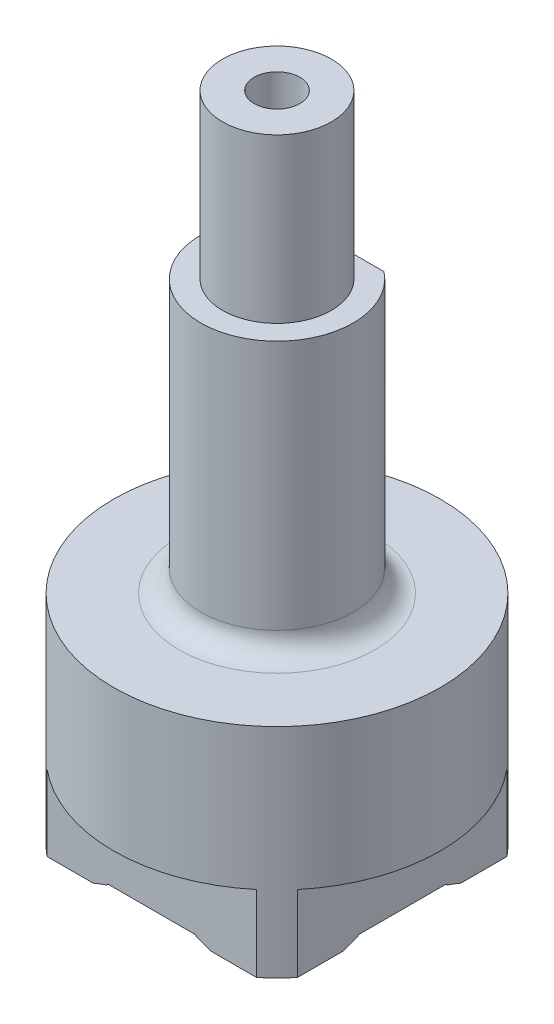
ISO-10303-21;
HEADER;
FILE_DESCRIPTION(('STEP AP214'),'2;1');
FILE_NAME('part.step','',(''),(''),'','','');
FILE_SCHEMA(('AUTOMOTIVE_DESIGN { 1 0 10303 214 1 1 1 1 }'));
ENDSEC;
DATA;
#1=APPLICATION_CONTEXT('core data for automotive mechanical design processes');
#2=APPLICATION_PROTOCOL_DEFINITION('international standard','automotive_design',2000,#1);
#3=PRODUCT_CONTEXT('',#1,'mechanical');
#4=PRODUCT('Part','Part','',(#3));
#5=PRODUCT_RELATED_PRODUCT_CATEGORY('part','',(#4));
#6=PRODUCT_DEFINITION_FORMATION('','',#4);
#7=PRODUCT_DEFINITION_CONTEXT('part definition',#1,'design');
#8=PRODUCT_DEFINITION('design','',#6,#7);
#9=PRODUCT_DEFINITION_SHAPE('','',#8);
#10=(LENGTH_UNIT() NAMED_UNIT(*) SI_UNIT(.MILLI.,.METRE.));
#11=(NAMED_UNIT(*) PLANE_ANGLE_UNIT() SI_UNIT($,.RADIAN.));
#12=(NAMED_UNIT(*) SI_UNIT($,.STERADIAN.) SOLID_ANGLE_UNIT());
#13=UNCERTAINTY_MEASURE_WITH_UNIT(LENGTH_MEASURE(1.E-05),#10,'distance_accuracy_value','');
#14=(GEOMETRIC_REPRESENTATION_CONTEXT(3) GLOBAL_UNCERTAINTY_ASSIGNED_CONTEXT((#13)) GLOBAL_UNIT_ASSIGNED_CONTEXT((#10,
#11,#12)) REPRESENTATION_CONTEXT('',''));
#15=CARTESIAN_POINT('',(0.,0.,0.));
#16=DIRECTION('',(0.,0.,1.));
#17=DIRECTION('',(1.,0.,0.));
#18=AXIS2_PLACEMENT_3D('',#15,#16,#17);
#19=CARTESIAN_POINT('',(0.,60.,0.));
#20=DIRECTION('',(0.,-1.,0.));
#21=DIRECTION('',(0.,0.,-1.));
#22=AXIS2_PLACEMENT_3D('',#19,#20,#21);
#23=CYLINDRICAL_SURFACE('',#22,15.);
#24=CARTESIAN_POINT('',(0.,20.,0.));
#25=DIRECTION('',(0.,1.,0.));
#26=DIRECTION('',(0.,0.,1.));
#27=AXIS2_PLACEMENT_3D('',#24,#25,#26);
#28=CIRCLE('',#27,15.);
#29=CARTESIAN_POINT('',(0.,20.,15.));
#30=VERTEX_POINT('',#29);
#31=EDGE_CURVE('E349',#30,#30,#28,.T.);
#32=ORIENTED_EDGE('',*,*,#31,.F.);
#33=EDGE_LOOP('',(#32));
#34=FACE_BOUND('',#33,.T.);
#35=DIRECTION('',(0.,-1.,0.));
#36=VECTOR('',#35,1.);
#37=CARTESIAN_POINT('',(-11.5,60.,-9.63068014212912));
#38=LINE('',#37,#36);
#39=CARTESIAN_POINT('',(-11.5,7.,-9.63068014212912));
#40=VERTEX_POINT('',#39);
#41=CARTESIAN_POINT('',(-11.5,0.,-9.63068014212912));
#42=VERTEX_POINT('',#41);
#43=EDGE_CURVE('E397',#40,#42,#38,.T.);
#44=ORIENTED_EDGE('',*,*,#43,.F.);
#45=CARTESIAN_POINT('',(0.,7.,0.));
#46=DIRECTION('',(0.,-1.,0.));
#47=DIRECTION('',(0.,0.,-1.));
#48=AXIS2_PLACEMENT_3D('',#45,#46,#47);
#49=CIRCLE('',#48,15.);
#50=CARTESIAN_POINT('',(-11.5,7.,9.63068014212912));
#51=VERTEX_POINT('',#50);
#52=EDGE_CURVE('E449',#51,#40,#49,.T.);
#53=ORIENTED_EDGE('',*,*,#52,.F.);
#54=DIRECTION('',(0.,-1.,0.));
#55=VECTOR('',#54,1.);
#56=CARTESIAN_POINT('',(-11.5,60.,9.63068014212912));
#57=LINE('',#56,#55);
#58=CARTESIAN_POINT('',(-11.5,0.,9.63068014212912));
#59=VERTEX_POINT('',#58);
#60=EDGE_CURVE('E501',#59,#51,#57,.F.);
#61=ORIENTED_EDGE('',*,*,#60,.F.);
#62=CARTESIAN_POINT('',(0.,0.,0.));
#63=DIRECTION('',(0.,1.,0.));
#64=DIRECTION('',(0.,0.,1.));
#65=AXIS2_PLACEMENT_3D('',#62,#63,#64);
#66=CIRCLE('',#65,15.);
#67=CARTESIAN_POINT('',(-9.63068014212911,0.,11.5));
#68=VERTEX_POINT('',#67);
#69=EDGE_CURVE('E353',#59,#68,#66,.T.);
#70=ORIENTED_EDGE('',*,*,#69,.T.);
#71=DIRECTION('',(0.,-1.,0.));
#72=VECTOR('',#71,1.);
#73=CARTESIAN_POINT('',(-9.63068014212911,60.,11.5));
#74=LINE('',#73,#72);
#75=CARTESIAN_POINT('',(-9.63068014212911,7.,11.5));
#76=VERTEX_POINT('',#75);
#77=EDGE_CURVE('E492',#76,#68,#74,.T.);
#78=ORIENTED_EDGE('',*,*,#77,.F.);
#79=CARTESIAN_POINT('',(9.63068014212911,7.,11.5));
#80=VERTEX_POINT('',#79);
#81=EDGE_CURVE('E451',#80,#76,#49,.T.);
#82=ORIENTED_EDGE('',*,*,#81,.F.);
#83=DIRECTION('',(0.,-1.,0.));
#84=VECTOR('',#83,1.);
#85=CARTESIAN_POINT('',(9.63068014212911,60.,11.5));
#86=LINE('',#85,#84);
#87=CARTESIAN_POINT('',(9.63068014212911,0.,11.5));
#88=VERTEX_POINT('',#87);
#89=EDGE_CURVE('E490',#88,#80,#86,.F.);
#90=ORIENTED_EDGE('',*,*,#89,.F.);
#91=CARTESIAN_POINT('',(11.5,0.,9.63068014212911));
#92=VERTEX_POINT('',#91);
#93=EDGE_CURVE('E356',#88,#92,#66,.T.);
#94=ORIENTED_EDGE('',*,*,#93,.T.);
#95=DIRECTION('',(0.,-1.,0.));
#96=VECTOR('',#95,1.);
#97=CARTESIAN_POINT('',(11.5,60.,9.6306801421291));
#98=LINE('',#97,#96);
#99=CARTESIAN_POINT('',(11.5,7.,9.63068014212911));
#100=VERTEX_POINT('',#99);
#101=EDGE_CURVE('E469',#100,#92,#98,.T.);
#102=ORIENTED_EDGE('',*,*,#101,.F.);
#103=CARTESIAN_POINT('',(11.5,7.,-9.6306801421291));
#104=VERTEX_POINT('',#103);
#105=EDGE_CURVE('E448',#104,#100,#49,.T.);
#106=ORIENTED_EDGE('',*,*,#105,.F.);
#107=DIRECTION('',(0.,-1.,0.));
#108=VECTOR('',#107,1.);
#109=CARTESIAN_POINT('',(11.5,60.,-9.6306801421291));
#110=LINE('',#109,#108);
#111=CARTESIAN_POINT('',(11.5,0.,-9.6306801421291));
#112=VERTEX_POINT('',#111);
#113=EDGE_CURVE('E471',#112,#104,#110,.F.);
#114=ORIENTED_EDGE('',*,*,#113,.F.);
#115=CARTESIAN_POINT('',(9.63068014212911,0.,-11.5));
#116=VERTEX_POINT('',#115);
#117=EDGE_CURVE('E360',#112,#116,#66,.T.);
#118=ORIENTED_EDGE('',*,*,#117,.T.);
#119=DIRECTION('',(0.,-1.,0.));
#120=VECTOR('',#119,1.);
#121=CARTESIAN_POINT('',(9.63068014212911,60.,-11.5));
#122=LINE('',#121,#120);
#123=CARTESIAN_POINT('',(9.63068014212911,7.,-11.5));
#124=VERTEX_POINT('',#123);
#125=EDGE_CURVE('E1116',#124,#116,#122,.T.);
#126=ORIENTED_EDGE('',*,*,#125,.F.);
#127=CARTESIAN_POINT('',(-9.63068014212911,7.,-11.5));
#128=VERTEX_POINT('',#127);
#129=EDGE_CURVE('E446',#128,#124,#49,.T.);
#130=ORIENTED_EDGE('',*,*,#129,.F.);
#131=DIRECTION('',(0.,-1.,0.));
#132=VECTOR('',#131,1.);
#133=CARTESIAN_POINT('',(-9.63068014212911,60.,-11.5));
#134=LINE('',#133,#132);
#135=CARTESIAN_POINT('',(-9.63068014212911,0.,-11.5));
#136=VERTEX_POINT('',#135);
#137=EDGE_CURVE('E1114',#136,#128,#134,.F.);
#138=ORIENTED_EDGE('',*,*,#137,.F.);
#139=EDGE_CURVE('E1145',#136,#42,#66,.T.);
#140=ORIENTED_EDGE('',*,*,#139,.T.);
#141=EDGE_LOOP('',(#44,#53,#61,#70,#78,#82,#90,#94,#102,#106,#114,#118,#126,#130,#138,#140));
#142=FACE_BOUND('',#141,.T.);
#143=ADVANCED_FACE('F16',(#34,#142),#23,.T.);
#144=CARTESIAN_POINT('',(0.,0.,0.));
#145=DIRECTION('',(0.,1.,0.));
#146=DIRECTION('',(0.,0.,1.));
#147=AXIS2_PLACEMENT_3D('',#144,#145,#146);
#148=PLANE('',#147);
#149=DIRECTION('',(0.,0.,-1.));
#150=VECTOR('',#149,1.);
#151=CARTESIAN_POINT('',(-11.5,0.,-11.5));
#152=LINE('',#151,#150);
#153=CARTESIAN_POINT('',(-11.5,0.,-5.38887743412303));
#154=VERTEX_POINT('',#153);
#155=EDGE_CURVE('E1079',#154,#42,#152,.T.);
#156=ORIENTED_EDGE('',*,*,#155,.T.);
#157=ORIENTED_EDGE('',*,*,#139,.F.);
#158=DIRECTION('',(1.,0.,0.));
#159=VECTOR('',#158,1.);
#160=CARTESIAN_POINT('',(11.5,0.,-11.5));
#161=LINE('',#160,#159);
#162=CARTESIAN_POINT('',(-5.38887743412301,0.,-11.5));
#163=VERTEX_POINT('',#162);
#164=EDGE_CURVE('E1141',#136,#163,#161,.T.);
#165=ORIENTED_EDGE('',*,*,#164,.T.);
#166=CARTESIAN_POINT('',(0.,0.,0.));
#167=DIRECTION('',(0.,1.,0.));
#168=DIRECTION('',(0.,0.,1.));
#169=AXIS2_PLACEMENT_3D('',#166,#167,#168);
#170=CIRCLE('',#169,12.7);
#171=EDGE_CURVE('E1083',#163,#154,#170,.T.);
#172=ORIENTED_EDGE('',*,*,#171,.T.);
#173=EDGE_LOOP('',(#156,#157,#165,#172));
#174=FACE_BOUND('',#173,.T.);
#175=ADVANCED_FACE('F621',(#174),#148,.F.);
#176=CARTESIAN_POINT('',(-11.5,0.,5.38887743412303));
#177=VERTEX_POINT('',#176);
#178=EDGE_CURVE('E1074',#59,#177,#152,.T.);
#179=ORIENTED_EDGE('',*,*,#178,.T.);
#180=CARTESIAN_POINT('',(-5.38887743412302,0.,11.5));
#181=VERTEX_POINT('',#180);
#182=EDGE_CURVE('E386',#177,#181,#170,.T.);
#183=ORIENTED_EDGE('',*,*,#182,.T.);
#184=DIRECTION('',(-1.,0.,0.));
#185=VECTOR('',#184,1.);
#186=CARTESIAN_POINT('',(11.5,0.,11.5));
#187=LINE('',#186,#185);
#188=EDGE_CURVE('E39',#181,#68,#187,.T.);
#189=ORIENTED_EDGE('',*,*,#188,.T.);
#190=ORIENTED_EDGE('',*,*,#69,.F.);
#191=EDGE_LOOP('',(#179,#183,#189,#190));
#192=FACE_BOUND('',#191,.T.);
#193=ADVANCED_FACE('F628',(#192),#148,.F.);
#194=CARTESIAN_POINT('',(5.38887743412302,0.,11.5));
#195=VERTEX_POINT('',#194);
#196=EDGE_CURVE('E1152',#88,#195,#187,.T.);
#197=ORIENTED_EDGE('',*,*,#196,.T.);
#198=CARTESIAN_POINT('',(11.5,0.,5.388877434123));
#199=VERTEX_POINT('',#198);
#200=EDGE_CURVE('E388',#195,#199,#170,.T.);
#201=ORIENTED_EDGE('',*,*,#200,.T.);
#202=DIRECTION('',(0.,0.,1.));
#203=VECTOR('',#202,1.);
#204=CARTESIAN_POINT('',(11.5,0.,-11.5));
#205=LINE('',#204,#203);
#206=EDGE_CURVE('E1146',#199,#92,#205,.T.);
#207=ORIENTED_EDGE('',*,*,#206,.T.);
#208=ORIENTED_EDGE('',*,*,#93,.F.);
#209=EDGE_LOOP('',(#197,#201,#207,#208));
#210=FACE_BOUND('',#209,.T.);
#211=ADVANCED_FACE('F1034',(#210),#148,.F.);
#212=CARTESIAN_POINT('',(11.5,0.,-5.388877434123));
#213=VERTEX_POINT('',#212);
#214=EDGE_CURVE('E1094',#112,#213,#205,.T.);
#215=ORIENTED_EDGE('',*,*,#214,.T.);
#216=CARTESIAN_POINT('',(5.38887743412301,0.,-11.5));
#217=VERTEX_POINT('',#216);
#218=EDGE_CURVE('E392',#213,#217,#170,.T.);
#219=ORIENTED_EDGE('',*,*,#218,.T.);
#220=EDGE_CURVE('E1078',#217,#116,#161,.T.);
#221=ORIENTED_EDGE('',*,*,#220,.T.);
#222=ORIENTED_EDGE('',*,*,#117,.F.);
#223=EDGE_LOOP('',(#215,#219,#221,#222));
#224=FACE_BOUND('',#223,.T.);
#225=ADVANCED_FACE('F631',(#224),#148,.F.);
#226=CARTESIAN_POINT('',(0.,0.6,0.));
#227=DIRECTION('',(0.,-1.,0.));
#228=DIRECTION('',(0.,0.,-1.));
#229=AXIS2_PLACEMENT_3D('',#226,#227,#228);
#230=CYLINDRICAL_SURFACE('',#229,12.2);
#231=DIRECTION('',(0.,-1.,0.));
#232=VECTOR('',#231,1.);
#233=CARTESIAN_POINT('',(-11.5,0.6,-4.07308237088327));
#234=LINE('',#233,#232);
#235=CARTESIAN_POINT('',(-11.5,0.500000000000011,-4.07308237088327));
#236=VERTEX_POINT('',#235);
#237=CARTESIAN_POINT('',(-11.5,0.6,-4.07308237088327));
#238=VERTEX_POINT('',#237);
#239=EDGE_CURVE('E494',#236,#238,#234,.F.);
#240=ORIENTED_EDGE('',*,*,#239,.F.);
#241=CARTESIAN_POINT('',(0.,0.500000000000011,0.));
#242=DIRECTION('',(0.,1.,0.));
#243=DIRECTION('',(0.,0.,1.));
#244=AXIS2_PLACEMENT_3D('',#241,#242,#243);
#245=CIRCLE('',#244,12.2);
#246=CARTESIAN_POINT('',(-4.07308237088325,0.500000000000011,-11.5));
#247=VERTEX_POINT('',#246);
#248=EDGE_CURVE('E387',#236,#247,#245,.F.);
#249=ORIENTED_EDGE('',*,*,#248,.T.);
#250=DIRECTION('',(0.,-1.,0.));
#251=VECTOR('',#250,1.);
#252=CARTESIAN_POINT('',(-4.07308237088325,0.6,-11.5));
#253=LINE('',#252,#251);
#254=CARTESIAN_POINT('',(-4.07308237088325,0.6,-11.5));
#255=VERTEX_POINT('',#254);
#256=EDGE_CURVE('E1107',#255,#247,#253,.T.);
#257=ORIENTED_EDGE('',*,*,#256,.F.);
#258=CARTESIAN_POINT('',(0.,0.6,0.));
#259=DIRECTION('',(0.,-1.,0.));
#260=DIRECTION('',(0.,0.,-1.));
#261=AXIS2_PLACEMENT_3D('',#258,#259,#260);
#262=CIRCLE('',#261,12.2);
#263=EDGE_CURVE('E355',#238,#255,#262,.T.);
#264=ORIENTED_EDGE('',*,*,#263,.F.);
#265=EDGE_LOOP('',(#240,#249,#257,#264));
#266=FACE_BOUND('',#265,.T.);
#267=ADVANCED_FACE('F700',(#266),#230,.F.);
#268=DIRECTION('',(0.,-1.,0.));
#269=VECTOR('',#268,1.);
#270=CARTESIAN_POINT('',(-11.5,0.6,4.07308237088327));
#271=LINE('',#270,#269);
#272=CARTESIAN_POINT('',(-11.5,0.6,4.07308237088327));
#273=VERTEX_POINT('',#272);
#274=CARTESIAN_POINT('',(-11.5,0.500000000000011,4.07308237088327));
#275=VERTEX_POINT('',#274);
#276=EDGE_CURVE('E499',#273,#275,#271,.T.);
#277=ORIENTED_EDGE('',*,*,#276,.F.);
#278=CARTESIAN_POINT('',(-4.07308237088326,0.6,11.5));
#279=VERTEX_POINT('',#278);
#280=EDGE_CURVE('E1160',#279,#273,#262,.T.);
#281=ORIENTED_EDGE('',*,*,#280,.F.);
#282=DIRECTION('',(0.,-1.,0.));
#283=VECTOR('',#282,1.);
#284=CARTESIAN_POINT('',(-4.07308237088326,0.6,11.5));
#285=LINE('',#284,#283);
#286=CARTESIAN_POINT('',(-4.07308237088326,0.500000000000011,11.5));
#287=VERTEX_POINT('',#286);
#288=EDGE_CURVE('E478',#287,#279,#285,.F.);
#289=ORIENTED_EDGE('',*,*,#288,.F.);
#290=EDGE_CURVE('E383',#287,#275,#245,.F.);
#291=ORIENTED_EDGE('',*,*,#290,.T.);
#292=EDGE_LOOP('',(#277,#281,#289,#291));
#293=FACE_BOUND('',#292,.T.);
#294=ADVANCED_FACE('F702',(#293),#230,.F.);
#295=DIRECTION('',(0.,-1.,0.));
#296=VECTOR('',#295,1.);
#297=CARTESIAN_POINT('',(4.07308237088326,0.6,11.5));
#298=LINE('',#297,#296);
#299=CARTESIAN_POINT('',(4.07308237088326,0.6,11.5));
#300=VERTEX_POINT('',#299);
#301=CARTESIAN_POINT('',(4.07308237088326,0.500000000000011,11.5));
#302=VERTEX_POINT('',#301);
#303=EDGE_CURVE('E488',#300,#302,#298,.T.);
#304=ORIENTED_EDGE('',*,*,#303,.F.);
#305=CARTESIAN_POINT('',(11.5,0.6,4.07308237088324));
#306=VERTEX_POINT('',#305);
#307=EDGE_CURVE('E354',#306,#300,#262,.T.);
#308=ORIENTED_EDGE('',*,*,#307,.F.);
#309=DIRECTION('',(0.,-1.,0.));
#310=VECTOR('',#309,1.);
#311=CARTESIAN_POINT('',(11.5,0.6,4.07308237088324));
#312=LINE('',#311,#310);
#313=CARTESIAN_POINT('',(11.5,0.500000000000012,4.07308237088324));
#314=VERTEX_POINT('',#313);
#315=EDGE_CURVE('E1118',#314,#306,#312,.F.);
#316=ORIENTED_EDGE('',*,*,#315,.F.);
#317=EDGE_CURVE('E382',#314,#302,#245,.F.);
#318=ORIENTED_EDGE('',*,*,#317,.T.);
#319=EDGE_LOOP('',(#304,#308,#316,#318));
#320=FACE_BOUND('',#319,.T.);
#321=ADVANCED_FACE('F1007',(#320),#230,.F.);
#322=DIRECTION('',(0.,-1.,0.));
#323=VECTOR('',#322,1.);
#324=CARTESIAN_POINT('',(11.5,0.6,-4.07308237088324));
#325=LINE('',#324,#323);
#326=CARTESIAN_POINT('',(11.5,0.6,-4.07308237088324));
#327=VERTEX_POINT('',#326);
#328=CARTESIAN_POINT('',(11.5,0.500000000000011,-4.07308237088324));
#329=VERTEX_POINT('',#328);
#330=EDGE_CURVE('E482',#327,#329,#325,.T.);
#331=ORIENTED_EDGE('',*,*,#330,.F.);
#332=CARTESIAN_POINT('',(4.07308237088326,0.6,-11.5));
#333=VERTEX_POINT('',#332);
#334=EDGE_CURVE('E350',#333,#327,#262,.T.);
#335=ORIENTED_EDGE('',*,*,#334,.F.);
#336=DIRECTION('',(0.,-1.,0.));
#337=VECTOR('',#336,1.);
#338=CARTESIAN_POINT('',(4.07308237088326,0.6,-11.5));
#339=LINE('',#338,#337);
#340=CARTESIAN_POINT('',(4.07308237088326,0.500000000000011,-11.5));
#341=VERTEX_POINT('',#340);
#342=EDGE_CURVE('E1101',#341,#333,#339,.F.);
#343=ORIENTED_EDGE('',*,*,#342,.F.);
#344=EDGE_CURVE('E1099',#341,#329,#245,.F.);
#345=ORIENTED_EDGE('',*,*,#344,.T.);
#346=EDGE_LOOP('',(#331,#335,#343,#345));
#347=FACE_BOUND('',#346,.T.);
#348=ADVANCED_FACE('F698',(#347),#230,.F.);
#349=CARTESIAN_POINT('',(0.,0.6,0.));
#350=DIRECTION('',(0.,-1.,0.));
#351=DIRECTION('',(0.,0.,-1.));
#352=AXIS2_PLACEMENT_3D('',#349,#350,#351);
#353=PLANE('',#352);
#354=CARTESIAN_POINT('',(0.,0.6,0.));
#355=DIRECTION('',(0.,-1.,0.));
#356=DIRECTION('',(0.,0.,-1.));
#357=AXIS2_PLACEMENT_3D('',#354,#355,#356);
#358=CIRCLE('',#357,10.25);
#359=CARTESIAN_POINT('',(0.,0.6,-10.25));
#360=VERTEX_POINT('',#359);
#361=EDGE_CURVE('E329',#360,#360,#358,.T.);
#362=ORIENTED_EDGE('',*,*,#361,.F.);
#363=EDGE_LOOP('',(#362));
#364=FACE_BOUND('',#363,.T.);
#365=ORIENTED_EDGE('',*,*,#280,.T.);
#366=DIRECTION('',(0.,0.,-1.));
#367=VECTOR('',#366,1.);
#368=CARTESIAN_POINT('',(-11.5,0.6,0.));
#369=LINE('',#368,#367);
#370=EDGE_CURVE('E496',#273,#238,#369,.T.);
#371=ORIENTED_EDGE('',*,*,#370,.T.);
#372=ORIENTED_EDGE('',*,*,#263,.T.);
#373=DIRECTION('',(1.,0.,0.));
#374=VECTOR('',#373,1.);
#375=CARTESIAN_POINT('',(0.,0.6,-11.5));
#376=LINE('',#375,#374);
#377=EDGE_CURVE('E1105',#255,#333,#376,.T.);
#378=ORIENTED_EDGE('',*,*,#377,.T.);
#379=ORIENTED_EDGE('',*,*,#334,.T.);
#380=DIRECTION('',(0.,0.,1.));
#381=VECTOR('',#380,1.);
#382=CARTESIAN_POINT('',(11.5,0.6,0.));
#383=LINE('',#382,#381);
#384=EDGE_CURVE('E1120',#327,#306,#383,.T.);
#385=ORIENTED_EDGE('',*,*,#384,.T.);
#386=ORIENTED_EDGE('',*,*,#307,.T.);
#387=DIRECTION('',(-1.,0.,0.));
#388=VECTOR('',#387,1.);
#389=CARTESIAN_POINT('',(0.,0.6,11.5));
#390=LINE('',#389,#388);
#391=EDGE_CURVE('E480',#300,#279,#390,.T.);
#392=ORIENTED_EDGE('',*,*,#391,.T.);
#393=EDGE_LOOP('',(#365,#371,#372,#378,#379,#385,#386,#392));
#394=FACE_BOUND('',#393,.T.);
#395=ADVANCED_FACE('F695',(#364,#394),#353,.T.);
#396=CARTESIAN_POINT('',(0.,0.500000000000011,0.));
#397=DIRECTION('',(0.,-1.,0.));
#398=DIRECTION('',(0.,0.,-1.));
#399=AXIS2_PLACEMENT_3D('',#396,#397,#398);
#400=CONICAL_SURFACE('',#399,12.2,0.785398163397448);
#401=ORIENTED_EDGE('',*,*,#182,.F.);
#402=CARTESIAN_POINT('',(-11.5,-13.8034604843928,23.878513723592));
#403=CARTESIAN_POINT('',(-11.5,-13.4899025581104,23.5304808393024));
#404=CARTESIAN_POINT('',(-11.5,-13.177050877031,23.1818128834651));
#405=CARTESIAN_POINT('',(-11.5,-12.5529623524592,22.48303413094));
#406=CARTESIAN_POINT('',(-11.5,-12.2417255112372,22.1329233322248));
#407=CARTESIAN_POINT('',(-11.5,-11.3105531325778,21.0799554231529));
#408=CARTESIAN_POINT('',(-11.5,-10.6933469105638,20.3746745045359));
#409=CARTESIAN_POINT('',(-11.5,-9.77160986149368,19.3068839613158));
#410=CARTESIAN_POINT('',(-11.5,-9.46349525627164,18.9474658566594));
#411=CARTESIAN_POINT('',(-11.5,-8.85013563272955,18.226201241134));
#412=CARTESIAN_POINT('',(-11.5,-8.54489054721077,17.8643547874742));
#413=CARTESIAN_POINT('',(-11.5,-7.9378048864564,17.1379333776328));
#414=CARTESIAN_POINT('',(-11.5,-7.63596366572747,16.77335896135));
#415=CARTESIAN_POINT('',(-11.5,-7.03620096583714,16.0409424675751));
#416=CARTESIAN_POINT('',(-11.5,-6.73827983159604,15.6731001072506));
#417=CARTESIAN_POINT('',(-11.5,-6.17525055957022,14.968816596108));
#418=CARTESIAN_POINT('',(-11.5,-5.90971649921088,14.6327162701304));
#419=CARTESIAN_POINT('',(-11.5,-5.38320074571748,13.9569702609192));
#420=CARTESIAN_POINT('',(-11.5,-5.1222189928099,13.6173246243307));
#421=CARTESIAN_POINT('',(-11.5,-4.60570618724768,12.933967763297));
#422=CARTESIAN_POINT('',(-11.5,-4.3501745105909,12.5902570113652));
#423=CARTESIAN_POINT('',(-11.5,-3.84564223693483,11.8980851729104));
#424=CARTESIAN_POINT('',(-11.5,-3.59664137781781,11.5496242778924));
#425=CARTESIAN_POINT('',(-11.5,-3.10709432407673,10.8479167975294));
#426=CARTESIAN_POINT('',(-11.5,-2.86653101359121,10.4946821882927));
#427=CARTESIAN_POINT('',(-11.5,-2.39507803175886,9.78176398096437));
#428=CARTESIAN_POINT('',(-11.5,-2.16418888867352,9.4220800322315));
#429=CARTESIAN_POINT('',(-11.5,-1.71460135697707,8.69552351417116));
#430=CARTESIAN_POINT('',(-11.5,-1.49589357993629,8.32865678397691));
#431=CARTESIAN_POINT('',(-11.5,-1.07353187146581,7.58639144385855));
#432=CARTESIAN_POINT('',(-11.5,-0.869875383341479,7.21099429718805));
#433=CARTESIAN_POINT('',(-11.5,-0.493408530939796,6.47380648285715));
#434=CARTESIAN_POINT('',(-11.5,-0.31947171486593,6.11259715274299));
#435=CARTESIAN_POINT('',(-11.5,-0.0741706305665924,5.56382610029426));
#436=CARTESIAN_POINT('',(-11.5,0.00499595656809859,5.37974225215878));
#437=CARTESIAN_POINT('',(-11.5,0.157560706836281,5.00912420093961));
#438=CARTESIAN_POINT('',(-11.5,0.230956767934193,4.82258913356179));
#439=CARTESIAN_POINT('',(-11.5,0.441132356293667,4.2603384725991));
#440=CARTESIAN_POINT('',(-11.5,0.568357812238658,3.88096727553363));
#441=CARTESIAN_POINT('',(-11.5,0.791697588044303,3.11324008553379));
#442=CARTESIAN_POINT('',(-11.5,0.887827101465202,2.72488858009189));
#443=CARTESIAN_POINT('',(-11.5,1.03161033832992,2.00167108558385));
#444=CARTESIAN_POINT('',(-11.5,1.08446890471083,1.66784716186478));
#445=CARTESIAN_POINT('',(-11.5,1.16167723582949,0.996913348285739));
#446=CARTESIAN_POINT('',(-11.5,1.18603135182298,0.659803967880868));
#447=CARTESIAN_POINT('',(-11.5,1.20492901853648,-0.0148970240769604));
#448=CARTESIAN_POINT('',(-11.5,1.19950493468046,-0.352487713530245));
#449=CARTESIAN_POINT('',(-11.5,1.15922778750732,-1.02591636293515));
#450=CARTESIAN_POINT('',(-11.5,1.12437046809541,-1.36175406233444));
#451=CARTESIAN_POINT('',(-11.5,1.01422601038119,-2.11679626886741));
#452=CARTESIAN_POINT('',(-11.5,0.930742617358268,-2.53480471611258));
#453=CARTESIAN_POINT('',(-11.5,0.7255136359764,-3.36141166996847));
#454=CARTESIAN_POINT('',(-11.5,0.603743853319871,-3.77000405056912));
#455=CARTESIAN_POINT('',(-11.5,0.397129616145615,-4.37572042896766));
#456=CARTESIAN_POINT('',(-11.5,0.32403281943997,-4.5769688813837));
#457=CARTESIAN_POINT('',(-11.5,0.170718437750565,-4.97663855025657));
#458=CARTESIAN_POINT('',(-11.5,0.0905041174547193,-5.17506101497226));
#459=CARTESIAN_POINT('',(-11.5,-0.0763001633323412,-5.5691765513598));
#460=CARTESIAN_POINT('',(-11.5,-0.162889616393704,-5.76486983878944));
#461=CARTESIAN_POINT('',(-11.5,-0.34176767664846,-6.15365647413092));
#462=CARTESIAN_POINT('',(-11.5,-0.434057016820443,-6.34674948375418));
#463=CARTESIAN_POINT('',(-11.5,-0.682993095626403,-6.85040438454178));
#464=CARTESIAN_POINT('',(-11.5,-0.843795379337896,-7.15891533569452));
#465=CARTESIAN_POINT('',(-11.5,-1.17646504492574,-7.76993866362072));
#466=CARTESIAN_POINT('',(-11.5,-1.34833433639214,-8.07244999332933));
#467=CARTESIAN_POINT('',(-11.5,-1.70135286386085,-8.67224175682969));
#468=CARTESIAN_POINT('',(-11.5,-1.88250773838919,-8.96951886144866));
#469=CARTESIAN_POINT('',(-11.5,-2.25246743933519,-9.55923605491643));
#470=CARTESIAN_POINT('',(-11.5,-2.4412718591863,-9.8516763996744));
#471=CARTESIAN_POINT('',(-11.5,-2.82579955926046,-10.4330289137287));
#472=CARTESIAN_POINT('',(-11.5,-3.02153917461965,-10.7219302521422));
#473=CARTESIAN_POINT('',(-11.5,-3.41848886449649,-11.2959576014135));
#474=CARTESIAN_POINT('',(-11.5,-3.61969913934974,-11.5810834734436));
#475=CARTESIAN_POINT('',(-11.5,-4.02669827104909,-12.1478942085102));
#476=CARTESIAN_POINT('',(-11.5,-4.23248552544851,-12.4295802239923));
#477=CARTESIAN_POINT('',(-11.5,-4.64804788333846,-12.9899982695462));
#478=CARTESIAN_POINT('',(-11.5,-4.85782306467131,-13.2687302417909));
#479=CARTESIAN_POINT('',(-11.5,-5.49408731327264,-14.1033771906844));
#480=CARTESIAN_POINT('',(-11.5,-5.9257712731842,-14.6553343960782));
#481=CARTESIAN_POINT('',(-11.5,-6.79957005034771,-15.7509421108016));
#482=CARTESIAN_POINT('',(-11.5,-7.24168550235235,-16.2945921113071));
#483=CARTESIAN_POINT('',(-11.5,-8.13339415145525,-17.3744904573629));
#484=CARTESIAN_POINT('',(-11.5,-8.58297655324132,-17.9107477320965));
#485=CARTESIAN_POINT('',(-11.5,-9.48848808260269,-18.9778445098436));
#486=CARTESIAN_POINT('',(-11.5,-9.94441706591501,-19.5086841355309));
#487=CARTESIAN_POINT('',(-11.5,-10.9647231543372,-20.6850969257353));
#488=CARTESIAN_POINT('',(-11.5,-11.5303795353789,-21.3295598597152));
#489=CARTESIAN_POINT('',(-11.5,-12.3817470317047,-22.290486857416));
#490=CARTESIAN_POINT('',(-11.5,-12.6652138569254,-22.6089452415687));
#491=CARTESIAN_POINT('',(-11.5,-13.2334123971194,-23.2446157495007));
#492=CARTESIAN_POINT('',(-11.5,-13.5181438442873,-23.5618281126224));
#493=CARTESIAN_POINT('',(-11.5,-13.8034604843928,-23.878513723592));
#494=B_SPLINE_CURVE_WITH_KNOTS('',3,(#402,#403,#404,#405,#406,#407,#408,#409,#410,#411,#412,
#413,#414,#415,#416,#417,#418,#419,#420,#421,#422,#423,#424,#425,#426,#427,#428,#429,#430,#431,
#432,#433,#434,#435,#436,#437,#438,#439,#440,#441,#442,#443,#444,#445,#446,#447,#448,#449,#450,
#451,#452,#453,#454,#455,#456,#457,#458,#459,#460,#461,#462,#463,#464,#465,#466,#467,#468,#469,
#470,#471,#472,#473,#474,#475,#476,#477,#478,#479,#480,#481,#482,#483,#484,#485,#486,#487,#488,
#489,#490,#491,#492,#493),.UNSPECIFIED.,.F.,.F.,(4,2,2,2,2,2,2,2,2,2,2,2,2,2,2,2,2,2,2,2,2,2,2,
2,2,2,2,2,2,2,2,2,2,2,2,2,2,2,2,2,2,2,2,2,2,4),(0.,1.40534674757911,2.81069547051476,
5.62224862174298,7.04246389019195,8.46264581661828,9.88255373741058,11.3025857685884,
12.5875613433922,13.8725200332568,15.1573308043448,16.4420899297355,17.7240712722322,
19.0061225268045,20.2871716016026,21.5680025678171,22.7701297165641,23.3711974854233,
23.9724832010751,25.1717330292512,26.3703960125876,27.3832272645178,28.3959038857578,
29.4074800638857,30.4192025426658,31.6958314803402,32.9732687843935,33.6154961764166,
34.2574304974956,34.8993137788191,35.5412797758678,36.5846922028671,37.6282851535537,
38.6725194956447,39.7166984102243,40.7635259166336,41.8103918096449,42.8568967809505,
43.9034222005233,46.0053915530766,48.1074891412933,50.2067744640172,52.3060121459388,
54.878447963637,56.1574772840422,57.4362475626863),.UNSPECIFIED.);
#495=EDGE_CURVE('E439',#177,#275,#494,.T.);
#496=ORIENTED_EDGE('',*,*,#495,.T.);
#497=ORIENTED_EDGE('',*,*,#290,.F.);
#498=CARTESIAN_POINT('',(23.878513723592,-13.8034604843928,11.5));
#499=CARTESIAN_POINT('',(23.5304808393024,-13.4899025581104,11.5));
#500=CARTESIAN_POINT('',(23.1818128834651,-13.177050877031,11.5));
#501=CARTESIAN_POINT('',(22.48303413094,-12.5529623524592,11.5));
#502=CARTESIAN_POINT('',(22.1329233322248,-12.2417255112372,11.5));
#503=CARTESIAN_POINT('',(21.0799554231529,-11.3105531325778,11.5));
#504=CARTESIAN_POINT('',(20.3746745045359,-10.6933469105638,11.5));
#505=CARTESIAN_POINT('',(19.3068839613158,-9.77160986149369,11.5));
#506=CARTESIAN_POINT('',(18.9474658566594,-9.46349525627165,11.5));
#507=CARTESIAN_POINT('',(18.226201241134,-8.85013563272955,11.5));
#508=CARTESIAN_POINT('',(17.8643547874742,-8.54489054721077,11.5));
#509=CARTESIAN_POINT('',(17.1379333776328,-7.9378048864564,11.5));
#510=CARTESIAN_POINT('',(16.77335896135,-7.63596366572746,11.5));
#511=CARTESIAN_POINT('',(16.040942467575,-7.03620096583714,11.5));
#512=CARTESIAN_POINT('',(15.6731001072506,-6.73827983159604,11.5));
#513=CARTESIAN_POINT('',(14.968816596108,-6.17525055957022,11.5));
#514=CARTESIAN_POINT('',(14.6327162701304,-5.90971649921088,11.5));
#515=CARTESIAN_POINT('',(13.9569702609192,-5.38320074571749,11.5));
#516=CARTESIAN_POINT('',(13.6173246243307,-5.1222189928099,11.5));
#517=CARTESIAN_POINT('',(12.933967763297,-4.60570618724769,11.5));
#518=CARTESIAN_POINT('',(12.5902570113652,-4.35017451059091,11.5));
#519=CARTESIAN_POINT('',(11.8980851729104,-3.84564223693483,11.5));
#520=CARTESIAN_POINT('',(11.5496242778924,-3.59664137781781,11.5));
#521=CARTESIAN_POINT('',(10.8479167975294,-3.10709432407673,11.5));
#522=CARTESIAN_POINT('',(10.4946821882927,-2.86653101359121,11.5));
#523=CARTESIAN_POINT('',(9.78176398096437,-2.39507803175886,11.5));
#524=CARTESIAN_POINT('',(9.4220800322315,-2.16418888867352,11.5));
#525=CARTESIAN_POINT('',(8.69552351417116,-1.71460135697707,11.5));
#526=CARTESIAN_POINT('',(8.32865678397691,-1.49589357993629,11.5));
#527=CARTESIAN_POINT('',(7.58639144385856,-1.07353187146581,11.5));
#528=CARTESIAN_POINT('',(7.21099429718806,-0.869875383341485,11.5));
#529=CARTESIAN_POINT('',(6.47380648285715,-0.493408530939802,11.5));
#530=CARTESIAN_POINT('',(6.11259715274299,-0.319471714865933,11.5));
#531=CARTESIAN_POINT('',(5.56382610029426,-0.0741706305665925,11.5));
#532=CARTESIAN_POINT('',(5.37974225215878,0.00499595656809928,11.5));
#533=CARTESIAN_POINT('',(5.00912420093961,0.157560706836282,11.5));
#534=CARTESIAN_POINT('',(4.82258913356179,0.230956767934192,11.5));
#535=CARTESIAN_POINT('',(4.2603384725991,0.441132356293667,11.5));
#536=CARTESIAN_POINT('',(3.88096727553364,0.568357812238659,11.5));
#537=CARTESIAN_POINT('',(3.11324008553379,0.791697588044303,11.5));
#538=CARTESIAN_POINT('',(2.72488858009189,0.887827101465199,11.5));
#539=CARTESIAN_POINT('',(2.00167108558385,1.03161033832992,11.5));
#540=CARTESIAN_POINT('',(1.66784716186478,1.08446890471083,11.5));
#541=CARTESIAN_POINT('',(0.996913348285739,1.16167723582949,11.5));
#542=CARTESIAN_POINT('',(0.659803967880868,1.18603135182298,11.5));
#543=CARTESIAN_POINT('',(-0.0148970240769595,1.20492901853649,11.5));
#544=CARTESIAN_POINT('',(-0.352487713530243,1.19950493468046,11.5));
#545=CARTESIAN_POINT('',(-1.02591636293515,1.15922778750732,11.5));
#546=CARTESIAN_POINT('',(-1.36175406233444,1.1243704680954,11.5));
#547=CARTESIAN_POINT('',(-2.11679626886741,1.01422601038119,11.5));
#548=CARTESIAN_POINT('',(-2.53480471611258,0.930742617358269,11.5));
#549=CARTESIAN_POINT('',(-3.36141166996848,0.725513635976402,11.5));
#550=CARTESIAN_POINT('',(-3.77000405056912,0.603743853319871,11.5));
#551=CARTESIAN_POINT('',(-4.37572042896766,0.397129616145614,11.5));
#552=CARTESIAN_POINT('',(-4.5769688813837,0.32403281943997,11.5));
#553=CARTESIAN_POINT('',(-4.97663855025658,0.170718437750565,11.5));
#554=CARTESIAN_POINT('',(-5.17506101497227,0.0905041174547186,11.5));
#555=CARTESIAN_POINT('',(-5.56917655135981,-0.0763001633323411,11.5));
#556=CARTESIAN_POINT('',(-5.76486983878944,-0.162889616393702,11.5));
#557=CARTESIAN_POINT('',(-6.15365647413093,-0.341767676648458,11.5));
#558=CARTESIAN_POINT('',(-6.34674948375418,-0.434057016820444,11.5));
#559=CARTESIAN_POINT('',(-6.85040438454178,-0.682993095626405,11.5));
#560=CARTESIAN_POINT('',(-7.15891533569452,-0.843795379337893,11.5));
#561=CARTESIAN_POINT('',(-7.76993866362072,-1.17646504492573,11.5));
#562=CARTESIAN_POINT('',(-8.07244999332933,-1.34833433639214,11.5));
#563=CARTESIAN_POINT('',(-8.67224175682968,-1.70135286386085,11.5));
#564=CARTESIAN_POINT('',(-8.96951886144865,-1.88250773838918,11.5));
#565=CARTESIAN_POINT('',(-9.55923605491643,-2.25246743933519,11.5));
#566=CARTESIAN_POINT('',(-9.8516763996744,-2.44127185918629,11.5));
#567=CARTESIAN_POINT('',(-10.4330289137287,-2.82579955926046,11.5));
#568=CARTESIAN_POINT('',(-10.7219302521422,-3.02153917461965,11.5));
#569=CARTESIAN_POINT('',(-11.2959576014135,-3.41848886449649,11.5));
#570=CARTESIAN_POINT('',(-11.5810834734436,-3.61969913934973,11.5));
#571=CARTESIAN_POINT('',(-12.1478942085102,-4.02669827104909,11.5));
#572=CARTESIAN_POINT('',(-12.4295802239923,-4.23248552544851,11.5));
#573=CARTESIAN_POINT('',(-12.9899982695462,-4.64804788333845,11.5));
#574=CARTESIAN_POINT('',(-13.2687302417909,-4.85782306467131,11.5));
#575=CARTESIAN_POINT('',(-14.1033771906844,-5.49408731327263,11.5));
#576=CARTESIAN_POINT('',(-14.6553343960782,-5.92577127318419,11.5));
#577=CARTESIAN_POINT('',(-15.7509421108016,-6.7995700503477,11.5));
#578=CARTESIAN_POINT('',(-16.2945921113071,-7.24168550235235,11.5));
#579=CARTESIAN_POINT('',(-17.3744904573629,-8.13339415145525,11.5));
#580=CARTESIAN_POINT('',(-17.9107477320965,-8.58297655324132,11.5));
#581=CARTESIAN_POINT('',(-18.9778445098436,-9.48848808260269,11.5));
#582=CARTESIAN_POINT('',(-19.5086841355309,-9.94441706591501,11.5));
#583=CARTESIAN_POINT('',(-20.6850969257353,-10.9647231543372,11.5));
#584=CARTESIAN_POINT('',(-21.3295598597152,-11.5303795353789,11.5));
#585=CARTESIAN_POINT('',(-22.290486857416,-12.3817470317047,11.5));
#586=CARTESIAN_POINT('',(-22.6089452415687,-12.6652138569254,11.5));
#587=CARTESIAN_POINT('',(-23.2446157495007,-13.2334123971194,11.5));
#588=CARTESIAN_POINT('',(-23.5618281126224,-13.5181438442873,11.5));
#589=CARTESIAN_POINT('',(-23.878513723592,-13.8034604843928,11.5));
#590=B_SPLINE_CURVE_WITH_KNOTS('',3,(#498,#499,#500,#501,#502,#503,#504,#505,#506,#507,#508,
#509,#510,#511,#512,#513,#514,#515,#516,#517,#518,#519,#520,#521,#522,#523,#524,#525,#526,#527,
#528,#529,#530,#531,#532,#533,#534,#535,#536,#537,#538,#539,#540,#541,#542,#543,#544,#545,#546,
#547,#548,#549,#550,#551,#552,#553,#554,#555,#556,#557,#558,#559,#560,#561,#562,#563,#564,#565,
#566,#567,#568,#569,#570,#571,#572,#573,#574,#575,#576,#577,#578,#579,#580,#581,#582,#583,#584,
#585,#586,#587,#588,#589),.UNSPECIFIED.,.F.,.F.,(4,2,2,2,2,2,2,2,2,2,2,2,2,2,2,2,2,2,2,2,2,2,2,
2,2,2,2,2,2,2,2,2,2,2,2,2,2,2,2,2,2,2,2,2,2,4),(0.,1.40534674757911,2.81069547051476,
5.62224862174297,7.04246389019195,8.46264581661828,9.88255373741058,11.3025857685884,
12.5875613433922,13.8725200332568,15.1573308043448,16.4420899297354,17.7240712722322,
19.0061225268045,20.2871716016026,21.5680025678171,22.7701297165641,23.3711974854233,
23.9724832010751,25.1717330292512,26.3703960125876,27.3832272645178,28.3959038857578,
29.4074800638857,30.4192025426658,31.6958314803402,32.9732687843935,33.6154961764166,
34.2574304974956,34.8993137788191,35.5412797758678,36.5846922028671,37.6282851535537,
38.6725194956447,39.7166984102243,40.7635259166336,41.8103918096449,42.8568967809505,
43.9034222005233,46.0053915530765,48.1074891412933,50.2067744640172,52.3060121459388,
54.878447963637,56.1574772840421,57.4362475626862),.UNSPECIFIED.);
#591=EDGE_CURVE('E441',#287,#181,#590,.T.);
#592=ORIENTED_EDGE('',*,*,#591,.T.);
#593=EDGE_LOOP('',(#401,#496,#497,#592));
#594=FACE_BOUND('',#593,.T.);
#595=ADVANCED_FACE('F18',(#594),#400,.F.);
#596=ORIENTED_EDGE('',*,*,#248,.F.);
#597=EDGE_CURVE('E432',#236,#154,#494,.T.);
#598=ORIENTED_EDGE('',*,*,#597,.T.);
#599=ORIENTED_EDGE('',*,*,#171,.F.);
#600=CARTESIAN_POINT('',(-23.878513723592,-13.8034604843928,-11.5));
#601=CARTESIAN_POINT('',(-23.5304808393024,-13.4899025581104,-11.5));
#602=CARTESIAN_POINT('',(-23.1818128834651,-13.177050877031,-11.5));
#603=CARTESIAN_POINT('',(-22.48303413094,-12.5529623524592,-11.5));
#604=CARTESIAN_POINT('',(-22.1329233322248,-12.2417255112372,-11.5));
#605=CARTESIAN_POINT('',(-21.0799554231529,-11.3105531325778,-11.5));
#606=CARTESIAN_POINT('',(-20.3746745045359,-10.6933469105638,-11.5));
#607=CARTESIAN_POINT('',(-19.3068839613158,-9.77160986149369,-11.5));
#608=CARTESIAN_POINT('',(-18.9474658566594,-9.46349525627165,-11.5));
#609=CARTESIAN_POINT('',(-18.226201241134,-8.85013563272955,-11.5));
#610=CARTESIAN_POINT('',(-17.8643547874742,-8.54489054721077,-11.5));
#611=CARTESIAN_POINT('',(-17.1379333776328,-7.93780488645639,-11.5));
#612=CARTESIAN_POINT('',(-16.77335896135,-7.63596366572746,-11.5));
#613=CARTESIAN_POINT('',(-16.040942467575,-7.03620096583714,-11.5));
#614=CARTESIAN_POINT('',(-15.6731001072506,-6.73827983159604,-11.5));
#615=CARTESIAN_POINT('',(-14.968816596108,-6.17525055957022,-11.5));
#616=CARTESIAN_POINT('',(-14.6327162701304,-5.90971649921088,-11.5));
#617=CARTESIAN_POINT('',(-13.9569702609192,-5.38320074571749,-11.5));
#618=CARTESIAN_POINT('',(-13.6173246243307,-5.1222189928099,-11.5));
#619=CARTESIAN_POINT('',(-12.933967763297,-4.60570618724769,-11.5));
#620=CARTESIAN_POINT('',(-12.5902570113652,-4.35017451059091,-11.5));
#621=CARTESIAN_POINT('',(-11.8980851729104,-3.84564223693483,-11.5));
#622=CARTESIAN_POINT('',(-11.5496242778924,-3.59664137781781,-11.5));
#623=CARTESIAN_POINT('',(-10.8479167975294,-3.10709432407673,-11.5));
#624=CARTESIAN_POINT('',(-10.4946821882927,-2.86653101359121,-11.5));
#625=CARTESIAN_POINT('',(-9.78176398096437,-2.39507803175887,-11.5));
#626=CARTESIAN_POINT('',(-9.4220800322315,-2.16418888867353,-11.5));
#627=CARTESIAN_POINT('',(-8.69552351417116,-1.71460135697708,-11.5));
#628=CARTESIAN_POINT('',(-8.32865678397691,-1.49589357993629,-11.5));
#629=CARTESIAN_POINT('',(-7.58639144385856,-1.07353187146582,-11.5));
#630=CARTESIAN_POINT('',(-7.21099429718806,-0.869875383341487,-11.5));
#631=CARTESIAN_POINT('',(-6.47380648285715,-0.493408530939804,-11.5));
#632=CARTESIAN_POINT('',(-6.11259715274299,-0.319471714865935,-11.5));
#633=CARTESIAN_POINT('',(-5.56382610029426,-0.0741706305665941,-11.5));
#634=CARTESIAN_POINT('',(-5.37974225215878,0.00499595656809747,-11.5));
#635=CARTESIAN_POINT('',(-5.00912420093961,0.15756070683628,-11.5));
#636=CARTESIAN_POINT('',(-4.82258913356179,0.230956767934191,-11.5));
#637=CARTESIAN_POINT('',(-4.2603384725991,0.441132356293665,-11.5));
#638=CARTESIAN_POINT('',(-3.88096727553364,0.568357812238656,-11.5));
#639=CARTESIAN_POINT('',(-3.11324008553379,0.791697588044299,-11.5));
#640=CARTESIAN_POINT('',(-2.72488858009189,0.887827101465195,-11.5));
#641=CARTESIAN_POINT('',(-2.00167108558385,1.03161033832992,-11.5));
#642=CARTESIAN_POINT('',(-1.66784716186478,1.08446890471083,-11.5));
#643=CARTESIAN_POINT('',(-0.996913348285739,1.16167723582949,-11.5));
#644=CARTESIAN_POINT('',(-0.659803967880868,1.18603135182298,-11.5));
#645=CARTESIAN_POINT('',(0.0148970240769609,1.20492901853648,-11.5));
#646=CARTESIAN_POINT('',(0.352487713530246,1.19950493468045,-11.5));
#647=CARTESIAN_POINT('',(1.02591636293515,1.15922778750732,-11.5));
#648=CARTESIAN_POINT('',(1.36175406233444,1.1243704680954,-11.5));
#649=CARTESIAN_POINT('',(2.11679626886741,1.01422601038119,-11.5));
#650=CARTESIAN_POINT('',(2.53480471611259,0.930742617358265,-11.5));
#651=CARTESIAN_POINT('',(3.36141166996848,0.725513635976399,-11.5));
#652=CARTESIAN_POINT('',(3.77000405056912,0.603743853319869,-11.5));
#653=CARTESIAN_POINT('',(4.37572042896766,0.397129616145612,-11.5));
#654=CARTESIAN_POINT('',(4.5769688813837,0.324032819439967,-11.5));
#655=CARTESIAN_POINT('',(4.97663855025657,0.170718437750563,-11.5));
#656=CARTESIAN_POINT('',(5.17506101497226,0.0905041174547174,-11.5));
#657=CARTESIAN_POINT('',(5.5691765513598,-0.076300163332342,-11.5));
#658=CARTESIAN_POINT('',(5.76486983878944,-0.162889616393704,-11.5));
#659=CARTESIAN_POINT('',(6.15365647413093,-0.341767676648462,-11.5));
#660=CARTESIAN_POINT('',(6.34674948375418,-0.434057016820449,-11.5));
#661=CARTESIAN_POINT('',(6.85040438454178,-0.68299309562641,-11.5));
#662=CARTESIAN_POINT('',(7.15891533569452,-0.843795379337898,-11.5));
#663=CARTESIAN_POINT('',(7.76993866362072,-1.17646504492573,-11.5));
#664=CARTESIAN_POINT('',(8.07244999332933,-1.34833433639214,-11.5));
#665=CARTESIAN_POINT('',(8.67224175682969,-1.70135286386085,-11.5));
#666=CARTESIAN_POINT('',(8.96951886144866,-1.88250773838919,-11.5));
#667=CARTESIAN_POINT('',(9.55923605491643,-2.25246743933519,-11.5));
#668=CARTESIAN_POINT('',(9.8516763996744,-2.4412718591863,-11.5));
#669=CARTESIAN_POINT('',(10.4330289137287,-2.82579955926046,-11.5));
#670=CARTESIAN_POINT('',(10.7219302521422,-3.02153917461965,-11.5));
#671=CARTESIAN_POINT('',(11.2959576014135,-3.41848886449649,-11.5));
#672=CARTESIAN_POINT('',(11.5810834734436,-3.61969913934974,-11.5));
#673=CARTESIAN_POINT('',(12.1478942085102,-4.02669827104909,-11.5));
#674=CARTESIAN_POINT('',(12.4295802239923,-4.23248552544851,-11.5));
#675=CARTESIAN_POINT('',(12.9899982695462,-4.64804788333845,-11.5));
#676=CARTESIAN_POINT('',(13.2687302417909,-4.85782306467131,-11.5));
#677=CARTESIAN_POINT('',(14.1033771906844,-5.49408731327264,-11.5));
#678=CARTESIAN_POINT('',(14.6553343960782,-5.9257712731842,-11.5));
#679=CARTESIAN_POINT('',(15.7509421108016,-6.79957005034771,-11.5));
#680=CARTESIAN_POINT('',(16.2945921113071,-7.24168550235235,-11.5));
#681=CARTESIAN_POINT('',(17.3744904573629,-8.13339415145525,-11.5));
#682=CARTESIAN_POINT('',(17.9107477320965,-8.58297655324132,-11.5));
#683=CARTESIAN_POINT('',(18.9778445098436,-9.48848808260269,-11.5));
#684=CARTESIAN_POINT('',(19.5086841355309,-9.94441706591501,-11.5));
#685=CARTESIAN_POINT('',(20.6850969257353,-10.9647231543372,-11.5));
#686=CARTESIAN_POINT('',(21.3295598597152,-11.5303795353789,-11.5));
#687=CARTESIAN_POINT('',(22.290486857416,-12.3817470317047,-11.5));
#688=CARTESIAN_POINT('',(22.6089452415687,-12.6652138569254,-11.5));
#689=CARTESIAN_POINT('',(23.2446157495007,-13.2334123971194,-11.5));
#690=CARTESIAN_POINT('',(23.5618281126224,-13.5181438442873,-11.5));
#691=CARTESIAN_POINT('',(23.878513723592,-13.8034604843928,-11.5));
#692=B_SPLINE_CURVE_WITH_KNOTS('',3,(#600,#601,#602,#603,#604,#605,#606,#607,#608,#609,#610,
#611,#612,#613,#614,#615,#616,#617,#618,#619,#620,#621,#622,#623,#624,#625,#626,#627,#628,#629,
#630,#631,#632,#633,#634,#635,#636,#637,#638,#639,#640,#641,#642,#643,#644,#645,#646,#647,#648,
#649,#650,#651,#652,#653,#654,#655,#656,#657,#658,#659,#660,#661,#662,#663,#664,#665,#666,#667,
#668,#669,#670,#671,#672,#673,#674,#675,#676,#677,#678,#679,#680,#681,#682,#683,#684,#685,#686,
#687,#688,#689,#690,#691),.UNSPECIFIED.,.F.,.F.,(4,2,2,2,2,2,2,2,2,2,2,2,2,2,2,2,2,2,2,2,2,2,2,
2,2,2,2,2,2,2,2,2,2,2,2,2,2,2,2,2,2,2,2,2,2,4),(0.,1.40534674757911,2.81069547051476,
5.62224862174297,7.04246389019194,8.46264581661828,9.88255373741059,11.3025857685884,
12.5875613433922,13.8725200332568,15.1573308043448,16.4420899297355,17.7240712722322,
19.0061225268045,20.2871716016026,21.5680025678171,22.7701297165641,23.3711974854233,
23.9724832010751,25.1717330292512,26.3703960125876,27.3832272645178,28.3959038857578,
29.4074800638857,30.4192025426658,31.6958314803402,32.9732687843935,33.6154961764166,
34.2574304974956,34.8993137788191,35.5412797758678,36.5846922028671,37.6282851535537,
38.6725194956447,39.7166984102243,40.7635259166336,41.8103918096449,42.8568967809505,
43.9034222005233,46.0053915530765,48.1074891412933,50.2067744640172,52.3060121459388,
54.878447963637,56.1574772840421,57.4362475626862),.UNSPECIFIED.);
#693=EDGE_CURVE('E405',#163,#247,#692,.T.);
#694=ORIENTED_EDGE('',*,*,#693,.T.);
#695=EDGE_LOOP('',(#596,#598,#599,#694));
#696=FACE_BOUND('',#695,.T.);
#697=ADVANCED_FACE('F974',(#696),#400,.F.);
#698=ORIENTED_EDGE('',*,*,#200,.F.);
#699=EDGE_CURVE('E440',#195,#302,#590,.T.);
#700=ORIENTED_EDGE('',*,*,#699,.T.);
#701=ORIENTED_EDGE('',*,*,#317,.F.);
#702=CARTESIAN_POINT('',(11.5,-13.8034604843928,-23.878513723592));
#703=CARTESIAN_POINT('',(11.5,-13.4899025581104,-23.5304808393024));
#704=CARTESIAN_POINT('',(11.5,-13.177050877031,-23.1818128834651));
#705=CARTESIAN_POINT('',(11.5,-12.5529623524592,-22.48303413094));
#706=CARTESIAN_POINT('',(11.5,-12.2417255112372,-22.1329233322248));
#707=CARTESIAN_POINT('',(11.5,-11.3105531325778,-21.0799554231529));
#708=CARTESIAN_POINT('',(11.5,-10.6933469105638,-20.3746745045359));
#709=CARTESIAN_POINT('',(11.5,-9.77160986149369,-19.3068839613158));
#710=CARTESIAN_POINT('',(11.5,-9.46349525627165,-18.9474658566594));
#711=CARTESIAN_POINT('',(11.5,-8.85013563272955,-18.226201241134));
#712=CARTESIAN_POINT('',(11.5,-8.54489054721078,-17.8643547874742));
#713=CARTESIAN_POINT('',(11.5,-7.9378048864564,-17.1379333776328));
#714=CARTESIAN_POINT('',(11.5,-7.63596366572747,-16.77335896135));
#715=CARTESIAN_POINT('',(11.5,-7.03620096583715,-16.0409424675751));
#716=CARTESIAN_POINT('',(11.5,-6.73827983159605,-15.6731001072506));
#717=CARTESIAN_POINT('',(11.5,-6.17525055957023,-14.968816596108));
#718=CARTESIAN_POINT('',(11.5,-5.90971649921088,-14.6327162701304));
#719=CARTESIAN_POINT('',(11.5,-5.38320074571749,-13.9569702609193));
#720=CARTESIAN_POINT('',(11.5,-5.12221899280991,-13.6173246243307));
#721=CARTESIAN_POINT('',(11.5,-4.60570618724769,-12.933967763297));
#722=CARTESIAN_POINT('',(11.5,-4.35017451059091,-12.5902570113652));
#723=CARTESIAN_POINT('',(11.5,-3.84564223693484,-11.8980851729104));
#724=CARTESIAN_POINT('',(11.5,-3.59664137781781,-11.5496242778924));
#725=CARTESIAN_POINT('',(11.5,-3.10709432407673,-10.8479167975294));
#726=CARTESIAN_POINT('',(11.5,-2.86653101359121,-10.4946821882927));
#727=CARTESIAN_POINT('',(11.5,-2.39507803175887,-9.78176398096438));
#728=CARTESIAN_POINT('',(11.5,-2.16418888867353,-9.4220800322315));
#729=CARTESIAN_POINT('',(11.5,-1.71460135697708,-8.69552351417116));
#730=CARTESIAN_POINT('',(11.5,-1.49589357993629,-8.32865678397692));
#731=CARTESIAN_POINT('',(11.5,-1.07353187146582,-7.58639144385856));
#732=CARTESIAN_POINT('',(11.5,-0.869875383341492,-7.21099429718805));
#733=CARTESIAN_POINT('',(11.5,-0.493408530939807,-6.47380648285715));
#734=CARTESIAN_POINT('',(11.5,-0.319471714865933,-6.11259715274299));
#735=CARTESIAN_POINT('',(11.5,-0.0741706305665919,-5.56382610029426));
#736=CARTESIAN_POINT('',(11.5,0.00499595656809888,-5.37974225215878));
#737=CARTESIAN_POINT('',(11.5,0.157560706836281,-5.00912420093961));
#738=CARTESIAN_POINT('',(11.5,0.230956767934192,-4.82258913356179));
#739=CARTESIAN_POINT('',(11.5,0.441132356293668,-4.26033847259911));
#740=CARTESIAN_POINT('',(11.5,0.56835781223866,-3.88096727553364));
#741=CARTESIAN_POINT('',(11.5,0.791697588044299,-3.11324008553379));
#742=CARTESIAN_POINT('',(11.5,0.887827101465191,-2.72488858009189));
#743=CARTESIAN_POINT('',(11.5,1.03161033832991,-2.00167108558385));
#744=CARTESIAN_POINT('',(11.5,1.08446890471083,-1.66784716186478));
#745=CARTESIAN_POINT('',(11.5,1.16167723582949,-0.99691334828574));
#746=CARTESIAN_POINT('',(11.5,1.18603135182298,-0.659803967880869));
#747=CARTESIAN_POINT('',(11.5,1.20492901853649,0.0148970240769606));
#748=CARTESIAN_POINT('',(11.5,1.19950493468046,0.352487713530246));
#749=CARTESIAN_POINT('',(11.5,1.15922778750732,1.02591636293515));
#750=CARTESIAN_POINT('',(11.5,1.1243704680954,1.36175406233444));
#751=CARTESIAN_POINT('',(11.5,1.01422601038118,2.11679626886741));
#752=CARTESIAN_POINT('',(11.5,0.930742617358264,2.53480471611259));
#753=CARTESIAN_POINT('',(11.5,0.725513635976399,3.36141166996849));
#754=CARTESIAN_POINT('',(11.5,0.603743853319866,3.77000405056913));
#755=CARTESIAN_POINT('',(11.5,0.39712961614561,4.37572042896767));
#756=CARTESIAN_POINT('',(11.5,0.324032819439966,4.57696888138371));
#757=CARTESIAN_POINT('',(11.5,0.170718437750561,4.97663855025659));
#758=CARTESIAN_POINT('',(11.5,0.0905041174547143,5.17506101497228));
#759=CARTESIAN_POINT('',(11.5,-0.0763001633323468,5.56917655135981));
#760=CARTESIAN_POINT('',(11.5,-0.162889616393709,5.76486983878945));
#761=CARTESIAN_POINT('',(11.5,-0.341767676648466,6.15365647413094));
#762=CARTESIAN_POINT('',(11.5,-0.434057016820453,6.34674948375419));
#763=CARTESIAN_POINT('',(11.5,-0.682993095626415,6.85040438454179));
#764=CARTESIAN_POINT('',(11.5,-0.843795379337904,7.15891533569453));
#765=CARTESIAN_POINT('',(11.5,-1.17646504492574,7.76993866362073));
#766=CARTESIAN_POINT('',(11.5,-1.34833433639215,8.07244999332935));
#767=CARTESIAN_POINT('',(11.5,-1.70135286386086,8.6722417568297));
#768=CARTESIAN_POINT('',(11.5,-1.8825077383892,8.96951886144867));
#769=CARTESIAN_POINT('',(11.5,-2.2524674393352,9.55923605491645));
#770=CARTESIAN_POINT('',(11.5,-2.4412718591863,9.85167639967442));
#771=CARTESIAN_POINT('',(11.5,-2.82579955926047,10.4330289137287));
#772=CARTESIAN_POINT('',(11.5,-3.02153917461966,10.7219302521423));
#773=CARTESIAN_POINT('',(11.5,-3.4184888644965,11.2959576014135));
#774=CARTESIAN_POINT('',(11.5,-3.61969913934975,11.5810834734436));
#775=CARTESIAN_POINT('',(11.5,-4.0266982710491,12.1478942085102));
#776=CARTESIAN_POINT('',(11.5,-4.23248552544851,12.4295802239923));
#777=CARTESIAN_POINT('',(11.5,-4.64804788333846,12.9899982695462));
#778=CARTESIAN_POINT('',(11.5,-4.85782306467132,13.2687302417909));
#779=CARTESIAN_POINT('',(11.5,-5.49408731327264,14.1033771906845));
#780=CARTESIAN_POINT('',(11.5,-5.9257712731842,14.6553343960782));
#781=CARTESIAN_POINT('',(11.5,-6.79957005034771,15.7509421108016));
#782=CARTESIAN_POINT('',(11.5,-7.24168550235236,16.2945921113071));
#783=CARTESIAN_POINT('',(11.5,-8.13339415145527,17.3744904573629));
#784=CARTESIAN_POINT('',(11.5,-8.58297655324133,17.9107477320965));
#785=CARTESIAN_POINT('',(11.5,-9.4884880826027,18.9778445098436));
#786=CARTESIAN_POINT('',(11.5,-9.94441706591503,19.5086841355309));
#787=CARTESIAN_POINT('',(11.5,-10.9647231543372,20.6850969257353));
#788=CARTESIAN_POINT('',(11.5,-11.5303795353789,21.3295598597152));
#789=CARTESIAN_POINT('',(11.5,-12.3817470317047,22.290486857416));
#790=CARTESIAN_POINT('',(11.5,-12.6652138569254,22.6089452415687));
#791=CARTESIAN_POINT('',(11.5,-13.2334123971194,23.2446157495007));
#792=CARTESIAN_POINT('',(11.5,-13.5181438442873,23.5618281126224));
#793=CARTESIAN_POINT('',(11.5,-13.8034604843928,23.878513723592));
#794=B_SPLINE_CURVE_WITH_KNOTS('',3,(#702,#703,#704,#705,#706,#707,#708,#709,#710,#711,#712,
#713,#714,#715,#716,#717,#718,#719,#720,#721,#722,#723,#724,#725,#726,#727,#728,#729,#730,#731,
#732,#733,#734,#735,#736,#737,#738,#739,#740,#741,#742,#743,#744,#745,#746,#747,#748,#749,#750,
#751,#752,#753,#754,#755,#756,#757,#758,#759,#760,#761,#762,#763,#764,#765,#766,#767,#768,#769,
#770,#771,#772,#773,#774,#775,#776,#777,#778,#779,#780,#781,#782,#783,#784,#785,#786,#787,#788,
#789,#790,#791,#792,#793),.UNSPECIFIED.,.F.,.F.,(4,2,2,2,2,2,2,2,2,2,2,2,2,2,2,2,2,2,2,2,2,2,2,
2,2,2,2,2,2,2,2,2,2,2,2,2,2,2,2,2,2,2,2,2,2,4),(0.,1.40534674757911,2.81069547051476,
5.62224862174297,7.04246389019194,8.46264581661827,9.88255373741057,11.3025857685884,
12.5875613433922,13.8725200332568,15.1573308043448,16.4420899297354,17.7240712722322,
19.0061225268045,20.2871716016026,21.5680025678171,22.7701297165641,23.3711974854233,
23.9724832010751,25.1717330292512,26.3703960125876,27.3832272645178,28.3959038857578,
29.4074800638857,30.4192025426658,31.6958314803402,32.9732687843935,33.6154961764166,
34.2574304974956,34.8993137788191,35.5412797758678,36.5846922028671,37.6282851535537,
38.6725194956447,39.7166984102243,40.7635259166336,41.8103918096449,42.8568967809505,
43.9034222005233,46.0053915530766,48.1074891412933,50.2067744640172,52.3060121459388,
54.878447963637,56.1574772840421,57.4362475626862),.UNSPECIFIED.);
#795=EDGE_CURVE('E406',#314,#199,#794,.T.);
#796=ORIENTED_EDGE('',*,*,#795,.T.);
#797=EDGE_LOOP('',(#698,#700,#701,#796));
#798=FACE_BOUND('',#797,.T.);
#799=ADVANCED_FACE('F964',(#798),#400,.F.);
#800=ORIENTED_EDGE('',*,*,#218,.F.);
#801=EDGE_CURVE('E1097',#213,#329,#794,.T.);
#802=ORIENTED_EDGE('',*,*,#801,.T.);
#803=ORIENTED_EDGE('',*,*,#344,.F.);
#804=EDGE_CURVE('E391',#341,#217,#692,.T.);
#805=ORIENTED_EDGE('',*,*,#804,.T.);
#806=EDGE_LOOP('',(#800,#802,#803,#805));
#807=FACE_BOUND('',#806,.T.);
#808=ADVANCED_FACE('F835',(#807),#400,.F.);
#809=CARTESIAN_POINT('',(0.,0.85,0.));
#810=DIRECTION('',(0.,1.,0.));
#811=DIRECTION('',(0.,0.,1.));
#812=AXIS2_PLACEMENT_3D('',#809,#810,#811);
#813=PLANE('',#812);
#814=DIRECTION('',(-1.,0.,0.));
#815=VECTOR('',#814,1.);
#816=CARTESIAN_POINT('',(10.2002170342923,0.85,0.75));
#817=LINE('',#816,#815);
#818=CARTESIAN_POINT('',(8.46684711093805,0.85,0.75));
#819=VERTEX_POINT('',#818);
#820=CARTESIAN_POINT('',(1.58113883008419,0.85,0.75));
#821=VERTEX_POINT('',#820);
#822=EDGE_CURVE('E312',#819,#821,#817,.T.);
#823=ORIENTED_EDGE('',*,*,#822,.T.);
#824=CARTESIAN_POINT('',(0.,0.85,0.));
#825=DIRECTION('',(0.,1.,0.));
#826=DIRECTION('',(0.,0.,1.));
#827=AXIS2_PLACEMENT_3D('',#824,#825,#826);
#828=CIRCLE('',#827,1.75);
#829=CARTESIAN_POINT('',(1.58113883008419,0.85,-0.75));
#830=VERTEX_POINT('',#829);
#831=EDGE_CURVE('E510',#821,#830,#828,.T.);
#832=ORIENTED_EDGE('',*,*,#831,.T.);
#833=DIRECTION('',(1.,0.,0.));
#834=VECTOR('',#833,1.);
#835=CARTESIAN_POINT('',(10.2002170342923,0.85,-0.75));
#836=LINE('',#835,#834);
#837=CARTESIAN_POINT('',(8.46684711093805,0.85,-0.75));
#838=VERTEX_POINT('',#837);
#839=EDGE_CURVE('E311',#830,#838,#836,.T.);
#840=ORIENTED_EDGE('',*,*,#839,.T.);
#841=CARTESIAN_POINT('',(0.,0.85,0.));
#842=DIRECTION('',(0.,1.,0.));
#843=DIRECTION('',(0.,0.,1.));
#844=AXIS2_PLACEMENT_3D('',#841,#842,#843);
#845=CIRCLE('',#844,8.5);
#846=EDGE_CURVE('E370',#838,#819,#845,.F.);
#847=ORIENTED_EDGE('',*,*,#846,.T.);
#848=EDGE_LOOP('',(#823,#832,#840,#847));
#849=FACE_BOUND('',#848,.T.);
#850=ADVANCED_FACE('F558',(#849),#813,.F.);
#851=DIRECTION('',(0.,0.,1.));
#852=VECTOR('',#851,1.);
#853=CARTESIAN_POINT('',(0.749999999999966,0.85,-10.2002170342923));
#854=LINE('',#853,#852);
#855=CARTESIAN_POINT('',(0.749999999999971,0.85,-8.46684711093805));
#856=VERTEX_POINT('',#855);
#857=CARTESIAN_POINT('',(0.75,0.85,-1.5811388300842));
#858=VERTEX_POINT('',#857);
#859=EDGE_CURVE('E290',#856,#858,#854,.T.);
#860=ORIENTED_EDGE('',*,*,#859,.T.);
#861=CARTESIAN_POINT('',(-0.75,0.85,-1.58113883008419));
#862=VERTEX_POINT('',#861);
#863=EDGE_CURVE('E532',#858,#862,#828,.T.);
#864=ORIENTED_EDGE('',*,*,#863,.T.);
#865=DIRECTION('',(0.,0.,-1.));
#866=VECTOR('',#865,1.);
#867=CARTESIAN_POINT('',(-0.750000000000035,0.85,-10.2002170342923));
#868=LINE('',#867,#866);
#869=CARTESIAN_POINT('',(-0.750000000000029,0.85,-8.46684711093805));
#870=VERTEX_POINT('',#869);
#871=EDGE_CURVE('E285',#862,#870,#868,.T.);
#872=ORIENTED_EDGE('',*,*,#871,.T.);
#873=CARTESIAN_POINT('',(0.,0.85,0.));
#874=DIRECTION('',(0.,1.,0.));
#875=DIRECTION('',(0.,0.,1.));
#876=AXIS2_PLACEMENT_3D('',#873,#874,#875);
#877=CIRCLE('',#876,8.5);
#878=EDGE_CURVE('E306',#870,#856,#877,.F.);
#879=ORIENTED_EDGE('',*,*,#878,.T.);
#880=EDGE_LOOP('',(#860,#864,#872,#879));
#881=FACE_BOUND('',#880,.T.);
#882=ADVANCED_FACE('F600',(#881),#813,.F.);
#883=CARTESIAN_POINT('',(-8.46684711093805,0.85,-0.75));
#884=VERTEX_POINT('',#883);
#885=CARTESIAN_POINT('',(-1.58113883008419,0.85,-0.75));
#886=VERTEX_POINT('',#885);
#887=EDGE_CURVE('E307',#884,#886,#836,.T.);
#888=ORIENTED_EDGE('',*,*,#887,.T.);
#889=CARTESIAN_POINT('',(-1.58113883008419,0.85,0.75));
#890=VERTEX_POINT('',#889);
#891=EDGE_CURVE('E511',#886,#890,#828,.T.);
#892=ORIENTED_EDGE('',*,*,#891,.T.);
#893=CARTESIAN_POINT('',(-8.46684711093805,0.85,0.75));
#894=VERTEX_POINT('',#893);
#895=EDGE_CURVE('E310',#890,#894,#817,.T.);
#896=ORIENTED_EDGE('',*,*,#895,.T.);
#897=EDGE_CURVE('E372',#894,#884,#845,.F.);
#898=ORIENTED_EDGE('',*,*,#897,.T.);
#899=EDGE_LOOP('',(#888,#892,#896,#898));
#900=FACE_BOUND('',#899,.T.);
#901=ADVANCED_FACE('F594',(#900),#813,.F.);
#902=CARTESIAN_POINT('',(0.,20.,0.));
#903=DIRECTION('',(0.,1.,0.));
#904=DIRECTION('',(0.,0.,1.));
#905=AXIS2_PLACEMENT_3D('',#902,#903,#904);
#906=PLANE('',#905);
#907=CARTESIAN_POINT('',(0.,20.,0.));
#908=DIRECTION('',(0.,1.,0.));
#909=DIRECTION('',(0.,0.,1.));
#910=AXIS2_PLACEMENT_3D('',#907,#908,#909);
#911=CIRCLE('',#910,9.);
#912=CARTESIAN_POINT('',(0.,20.,9.));
#913=VERTEX_POINT('',#912);
#914=EDGE_CURVE('E379',#913,#913,#911,.F.);
#915=ORIENTED_EDGE('',*,*,#914,.T.);
#916=EDGE_LOOP('',(#915));
#917=FACE_BOUND('',#916,.T.);
#918=ORIENTED_EDGE('',*,*,#31,.T.);
#919=EDGE_LOOP('',(#918));
#920=FACE_BOUND('',#919,.T.);
#921=ADVANCED_FACE('F691',(#917,#920),#906,.T.);
#922=CARTESIAN_POINT('',(0.,0.6,0.));
#923=DIRECTION('',(0.,-1.,0.));
#924=DIRECTION('',(0.,0.,-1.));
#925=AXIS2_PLACEMENT_3D('',#922,#923,#924);
#926=CIRCLE('',#925,1.75);
#927=CARTESIAN_POINT('',(1.58113883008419,0.6,0.75));
#928=VERTEX_POINT('',#927);
#929=CARTESIAN_POINT('',(0.75,0.6,1.58113883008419));
#930=VERTEX_POINT('',#929);
#931=EDGE_CURVE('E519',#928,#930,#926,.T.);
#932=ORIENTED_EDGE('',*,*,#931,.F.);
#933=DIRECTION('',(-1.,0.,0.));
#934=VECTOR('',#933,1.);
#935=CARTESIAN_POINT('',(0.,0.6,0.75));
#936=LINE('',#935,#934);
#937=CARTESIAN_POINT('',(8.46684711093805,0.6,0.75));
#938=VERTEX_POINT('',#937);
#939=EDGE_CURVE('E367',#938,#928,#936,.T.);
#940=ORIENTED_EDGE('',*,*,#939,.F.);
#941=CARTESIAN_POINT('',(0.,0.6,0.));
#942=DIRECTION('',(0.,-1.,0.));
#943=DIRECTION('',(0.,0.,-1.));
#944=AXIS2_PLACEMENT_3D('',#941,#942,#943);
#945=CIRCLE('',#944,8.5);
#946=CARTESIAN_POINT('',(0.750000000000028,0.6,8.46684711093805));
#947=VERTEX_POINT('',#946);
#948=EDGE_CURVE('E330',#938,#947,#945,.T.);
#949=ORIENTED_EDGE('',*,*,#948,.T.);
#950=DIRECTION('',(0.,0.,1.));
#951=VECTOR('',#950,1.);
#952=CARTESIAN_POINT('',(0.749999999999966,0.6,-10.2002170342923));
#953=LINE('',#952,#951);
#954=EDGE_CURVE('E292',#930,#947,#953,.T.);
#955=ORIENTED_EDGE('',*,*,#954,.F.);
#956=EDGE_LOOP('',(#932,#940,#949,#955));
#957=FACE_BOUND('',#956,.T.);
#958=ADVANCED_FACE('F565',(#957),#353,.T.);
#959=CARTESIAN_POINT('',(0.,0.6,0.));
#960=DIRECTION('',(0.,-1.,0.));
#961=DIRECTION('',(0.,0.,-1.));
#962=AXIS2_PLACEMENT_3D('',#959,#960,#961);
#963=CIRCLE('',#962,1.75);
#964=CARTESIAN_POINT('',(0.75,0.6,-1.5811388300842));
#965=VERTEX_POINT('',#964);
#966=CARTESIAN_POINT('',(1.58113883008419,0.6,-0.75));
#967=VERTEX_POINT('',#966);
#968=EDGE_CURVE('E281',#965,#967,#963,.T.);
#969=ORIENTED_EDGE('',*,*,#968,.F.);
#970=CARTESIAN_POINT('',(0.749999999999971,0.6,-8.46684711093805));
#971=VERTEX_POINT('',#970);
#972=EDGE_CURVE('E288',#971,#965,#953,.T.);
#973=ORIENTED_EDGE('',*,*,#972,.F.);
#974=CARTESIAN_POINT('',(8.46684711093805,0.6,-0.75));
#975=VERTEX_POINT('',#974);
#976=EDGE_CURVE('E325',#971,#975,#945,.T.);
#977=ORIENTED_EDGE('',*,*,#976,.T.);
#978=DIRECTION('',(1.,0.,0.));
#979=VECTOR('',#978,1.);
#980=CARTESIAN_POINT('',(0.,0.6,-0.75));
#981=LINE('',#980,#979);
#982=EDGE_CURVE('E359',#967,#975,#981,.T.);
#983=ORIENTED_EDGE('',*,*,#982,.F.);
#984=EDGE_LOOP('',(#969,#973,#977,#983));
#985=FACE_BOUND('',#984,.T.);
#986=ADVANCED_FACE('F546',(#985),#353,.T.);
#987=CARTESIAN_POINT('',(10.2002170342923,0.85,0.75));
#988=DIRECTION('',(0.,0.,1.));
#989=DIRECTION('',(1.,0.,0.));
#990=AXIS2_PLACEMENT_3D('',#987,#988,#989);
#991=PLANE('',#990);
#992=ORIENTED_EDGE('',*,*,#939,.T.);
#993=DIRECTION('',(0.,1.,0.));
#994=VECTOR('',#993,1.);
#995=CARTESIAN_POINT('',(1.58113883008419,0.,0.75));
#996=LINE('',#995,#994);
#997=EDGE_CURVE('E526',#928,#821,#996,.T.);
#998=ORIENTED_EDGE('',*,*,#997,.T.);
#999=ORIENTED_EDGE('',*,*,#822,.F.);
#1000=DIRECTION('',(0.,-1.,0.));
#1001=VECTOR('',#1000,1.);
#1002=CARTESIAN_POINT('',(8.46684711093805,2.4,0.75));
#1003=LINE('',#1002,#1001);
#1004=EDGE_CURVE('E320',#819,#938,#1003,.T.);
#1005=ORIENTED_EDGE('',*,*,#1004,.T.);
#1006=EDGE_LOOP('',(#992,#998,#999,#1005));
#1007=FACE_BOUND('',#1006,.T.);
#1008=ADVANCED_FACE('F560',(#1007),#991,.F.);
#1009=CARTESIAN_POINT('',(10.2002170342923,0.85,-0.75));
#1010=DIRECTION('',(0.,0.,-1.));
#1011=DIRECTION('',(-1.,0.,0.));
#1012=AXIS2_PLACEMENT_3D('',#1009,#1010,#1011);
#1013=PLANE('',#1012);
#1014=ORIENTED_EDGE('',*,*,#839,.F.);
#1015=DIRECTION('',(0.,1.,0.));
#1016=VECTOR('',#1015,1.);
#1017=CARTESIAN_POINT('',(1.58113883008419,0.,-0.75));
#1018=LINE('',#1017,#1016);
#1019=EDGE_CURVE('E533',#830,#967,#1018,.F.);
#1020=ORIENTED_EDGE('',*,*,#1019,.T.);
#1021=ORIENTED_EDGE('',*,*,#982,.T.);
#1022=DIRECTION('',(0.,-1.,0.));
#1023=VECTOR('',#1022,1.);
#1024=CARTESIAN_POINT('',(8.46684711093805,2.4,-0.75));
#1025=LINE('',#1024,#1023);
#1026=EDGE_CURVE('E317',#975,#838,#1025,.F.);
#1027=ORIENTED_EDGE('',*,*,#1026,.T.);
#1028=EDGE_LOOP('',(#1014,#1020,#1021,#1027));
#1029=FACE_BOUND('',#1028,.T.);
#1030=ADVANCED_FACE('F544',(#1029),#1013,.F.);
#1031=CARTESIAN_POINT('',(0.,0.6,0.));
#1032=DIRECTION('',(0.,-1.,0.));
#1033=DIRECTION('',(0.,0.,-1.));
#1034=AXIS2_PLACEMENT_3D('',#1031,#1032,#1033);
#1035=CIRCLE('',#1034,1.75);
#1036=CARTESIAN_POINT('',(-0.75,0.6,1.58113883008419));
#1037=VERTEX_POINT('',#1036);
#1038=CARTESIAN_POINT('',(-1.58113883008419,0.6,0.75));
#1039=VERTEX_POINT('',#1038);
#1040=EDGE_CURVE('E509',#1037,#1039,#1035,.T.);
#1041=ORIENTED_EDGE('',*,*,#1040,.F.);
#1042=DIRECTION('',(0.,0.,-1.));
#1043=VECTOR('',#1042,1.);
#1044=CARTESIAN_POINT('',(-0.750000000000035,0.6,-10.2002170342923));
#1045=LINE('',#1044,#1043);
#1046=CARTESIAN_POINT('',(-0.749999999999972,0.6,8.46684711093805));
#1047=VERTEX_POINT('',#1046);
#1048=EDGE_CURVE('E278',#1047,#1037,#1045,.T.);
#1049=ORIENTED_EDGE('',*,*,#1048,.F.);
#1050=CARTESIAN_POINT('',(-8.46684711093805,0.6,0.75));
#1051=VERTEX_POINT('',#1050);
#1052=EDGE_CURVE('E334',#1047,#1051,#945,.T.);
#1053=ORIENTED_EDGE('',*,*,#1052,.T.);
#1054=EDGE_CURVE('E366',#1039,#1051,#936,.T.);
#1055=ORIENTED_EDGE('',*,*,#1054,.F.);
#1056=EDGE_LOOP('',(#1041,#1049,#1053,#1055));
#1057=FACE_BOUND('',#1056,.T.);
#1058=ADVANCED_FACE('F585',(#1057),#353,.T.);
#1059=CARTESIAN_POINT('',(0.,2.4,0.));
#1060=DIRECTION('',(0.,-1.,0.));
#1061=DIRECTION('',(0.,0.,-1.));
#1062=AXIS2_PLACEMENT_3D('',#1059,#1060,#1061);
#1063=CYLINDRICAL_SURFACE('',#1062,10.25);
#1064=CARTESIAN_POINT('',(0.,2.4,0.));
#1065=DIRECTION('',(0.,-1.,0.));
#1066=DIRECTION('',(0.,0.,-1.));
#1067=AXIS2_PLACEMENT_3D('',#1064,#1065,#1066);
#1068=CIRCLE('',#1067,10.25);
#1069=CARTESIAN_POINT('',(0.,2.4,-10.25));
#1070=VERTEX_POINT('',#1069);
#1071=EDGE_CURVE('E335',#1070,#1070,#1068,.T.);
#1072=ORIENTED_EDGE('',*,*,#1071,.F.);
#1073=EDGE_LOOP('',(#1072));
#1074=FACE_BOUND('',#1073,.T.);
#1075=ORIENTED_EDGE('',*,*,#361,.T.);
#1076=EDGE_LOOP('',(#1075));
#1077=FACE_BOUND('',#1076,.T.);
#1078=ADVANCED_FACE('F683',(#1074,#1077),#1063,.F.);
#1079=CARTESIAN_POINT('',(0.,2.4,0.));
#1080=DIRECTION('',(0.,-1.,0.));
#1081=DIRECTION('',(0.,0.,-1.));
#1082=AXIS2_PLACEMENT_3D('',#1079,#1080,#1081);
#1083=PLANE('',#1082);
#1084=CARTESIAN_POINT('',(0.,2.4,0.));
#1085=DIRECTION('',(0.,-1.,0.));
#1086=DIRECTION('',(0.,0.,-1.));
#1087=AXIS2_PLACEMENT_3D('',#1084,#1085,#1086);
#1088=CIRCLE('',#1087,8.5);
#1089=CARTESIAN_POINT('',(0.,2.4,-8.5));
#1090=VERTEX_POINT('',#1089);
#1091=EDGE_CURVE('E326',#1090,#1090,#1088,.T.);
#1092=ORIENTED_EDGE('',*,*,#1091,.F.);
#1093=EDGE_LOOP('',(#1092));
#1094=FACE_BOUND('',#1093,.T.);
#1095=ORIENTED_EDGE('',*,*,#1071,.T.);
#1096=EDGE_LOOP('',(#1095));
#1097=FACE_BOUND('',#1096,.T.);
#1098=ADVANCED_FACE('F680',(#1094,#1097),#1083,.T.);
#1099=CARTESIAN_POINT('',(0.,2.4,0.));
#1100=DIRECTION('',(0.,-1.,0.));
#1101=DIRECTION('',(0.,0.,-1.));
#1102=AXIS2_PLACEMENT_3D('',#1099,#1100,#1101);
#1103=CYLINDRICAL_SURFACE('',#1102,8.5);
#1104=DIRECTION('',(0.,-1.,0.));
#1105=VECTOR('',#1104,1.);
#1106=CARTESIAN_POINT('',(0.749999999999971,2.4,-8.46684711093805));
#1107=LINE('',#1106,#1105);
#1108=EDGE_CURVE('E299',#856,#971,#1107,.T.);
#1109=ORIENTED_EDGE('',*,*,#1108,.F.);
#1110=ORIENTED_EDGE('',*,*,#878,.F.);
#1111=DIRECTION('',(0.,-1.,0.));
#1112=VECTOR('',#1111,1.);
#1113=CARTESIAN_POINT('',(-0.750000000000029,2.4,-8.46684711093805));
#1114=LINE('',#1113,#1112);
#1115=CARTESIAN_POINT('',(-0.750000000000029,0.6,-8.46684711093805));
#1116=VERTEX_POINT('',#1115);
#1117=EDGE_CURVE('E296',#1116,#870,#1114,.F.);
#1118=ORIENTED_EDGE('',*,*,#1117,.F.);
#1119=CARTESIAN_POINT('',(-8.46684711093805,0.6,-0.75));
#1120=VERTEX_POINT('',#1119);
#1121=EDGE_CURVE('E331',#1120,#1116,#945,.T.);
#1122=ORIENTED_EDGE('',*,*,#1121,.F.);
#1123=DIRECTION('',(0.,-1.,0.));
#1124=VECTOR('',#1123,1.);
#1125=CARTESIAN_POINT('',(-8.46684711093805,2.4,-0.75));
#1126=LINE('',#1125,#1124);
#1127=EDGE_CURVE('E315',#884,#1120,#1126,.T.);
#1128=ORIENTED_EDGE('',*,*,#1127,.F.);
#1129=ORIENTED_EDGE('',*,*,#897,.F.);
#1130=DIRECTION('',(0.,-1.,0.));
#1131=VECTOR('',#1130,1.);
#1132=CARTESIAN_POINT('',(-8.46684711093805,2.4,0.75));
#1133=LINE('',#1132,#1131);
#1134=EDGE_CURVE('E322',#1051,#894,#1133,.F.);
#1135=ORIENTED_EDGE('',*,*,#1134,.F.);
#1136=ORIENTED_EDGE('',*,*,#1052,.F.);
#1137=DIRECTION('',(0.,-1.,0.));
#1138=VECTOR('',#1137,1.);
#1139=CARTESIAN_POINT('',(-0.749999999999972,2.4,8.46684711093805));
#1140=LINE('',#1139,#1138);
#1141=CARTESIAN_POINT('',(-0.749999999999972,0.85,8.46684711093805));
#1142=VERTEX_POINT('',#1141);
#1143=EDGE_CURVE('E294',#1142,#1047,#1140,.T.);
#1144=ORIENTED_EDGE('',*,*,#1143,.F.);
#1145=CARTESIAN_POINT('',(0.750000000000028,0.85,8.46684711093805));
#1146=VERTEX_POINT('',#1145);
#1147=EDGE_CURVE('E304',#1146,#1142,#877,.F.);
#1148=ORIENTED_EDGE('',*,*,#1147,.F.);
#1149=DIRECTION('',(0.,-1.,0.));
#1150=VECTOR('',#1149,1.);
#1151=CARTESIAN_POINT('',(0.750000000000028,2.4,8.46684711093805));
#1152=LINE('',#1151,#1150);
#1153=EDGE_CURVE('E301',#947,#1146,#1152,.F.);
#1154=ORIENTED_EDGE('',*,*,#1153,.F.);
#1155=ORIENTED_EDGE('',*,*,#948,.F.);
#1156=ORIENTED_EDGE('',*,*,#1004,.F.);
#1157=ORIENTED_EDGE('',*,*,#846,.F.);
#1158=ORIENTED_EDGE('',*,*,#1026,.F.);
#1159=ORIENTED_EDGE('',*,*,#976,.F.);
#1160=EDGE_LOOP('',(#1109,#1110,#1118,#1122,#1128,#1129,#1135,#1136,#1144,#1148,#1154,#1155,
#1156,#1157,#1158,#1159));
#1161=FACE_BOUND('',#1160,.T.);
#1162=ORIENTED_EDGE('',*,*,#1091,.T.);
#1163=EDGE_LOOP('',(#1162));
#1164=FACE_BOUND('',#1163,.T.);
#1165=ADVANCED_FACE('F552',(#1161,#1164),#1103,.T.);
#1166=CARTESIAN_POINT('',(0.,0.6,0.));
#1167=DIRECTION('',(0.,-1.,0.));
#1168=DIRECTION('',(0.,0.,-1.));
#1169=AXIS2_PLACEMENT_3D('',#1166,#1167,#1168);
#1170=CIRCLE('',#1169,1.75);
#1171=CARTESIAN_POINT('',(-1.58113883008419,0.6,-0.75));
#1172=VERTEX_POINT('',#1171);
#1173=CARTESIAN_POINT('',(-0.75,0.6,-1.58113883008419));
#1174=VERTEX_POINT('',#1173);
#1175=EDGE_CURVE('E524',#1172,#1174,#1170,.T.);
#1176=ORIENTED_EDGE('',*,*,#1175,.F.);
#1177=EDGE_CURVE('E363',#1120,#1172,#981,.T.);
#1178=ORIENTED_EDGE('',*,*,#1177,.F.);
#1179=ORIENTED_EDGE('',*,*,#1121,.T.);
#1180=EDGE_CURVE('E275',#1174,#1116,#1045,.T.);
#1181=ORIENTED_EDGE('',*,*,#1180,.F.);
#1182=EDGE_LOOP('',(#1176,#1178,#1179,#1181));
#1183=FACE_BOUND('',#1182,.T.);
#1184=ADVANCED_FACE('F674',(#1183),#353,.T.);
#1185=ORIENTED_EDGE('',*,*,#895,.F.);
#1186=DIRECTION('',(0.,1.,0.));
#1187=VECTOR('',#1186,1.);
#1188=CARTESIAN_POINT('',(-1.58113883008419,0.,0.75));
#1189=LINE('',#1188,#1187);
#1190=EDGE_CURVE('E516',#890,#1039,#1189,.F.);
#1191=ORIENTED_EDGE('',*,*,#1190,.T.);
#1192=ORIENTED_EDGE('',*,*,#1054,.T.);
#1193=ORIENTED_EDGE('',*,*,#1134,.T.);
#1194=EDGE_LOOP('',(#1185,#1191,#1192,#1193));
#1195=FACE_BOUND('',#1194,.T.);
#1196=ADVANCED_FACE('F590',(#1195),#991,.F.);
#1197=ORIENTED_EDGE('',*,*,#1177,.T.);
#1198=DIRECTION('',(0.,1.,0.));
#1199=VECTOR('',#1198,1.);
#1200=CARTESIAN_POINT('',(-1.58113883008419,0.,-0.75));
#1201=LINE('',#1200,#1199);
#1202=EDGE_CURVE('E521',#1172,#886,#1201,.T.);
#1203=ORIENTED_EDGE('',*,*,#1202,.T.);
#1204=ORIENTED_EDGE('',*,*,#887,.F.);
#1205=ORIENTED_EDGE('',*,*,#1127,.T.);
#1206=EDGE_LOOP('',(#1197,#1203,#1204,#1205));
#1207=FACE_BOUND('',#1206,.T.);
#1208=ADVANCED_FACE('F671',(#1207),#1013,.F.);
#1209=CARTESIAN_POINT('',(-0.75,0.85,1.58113883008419));
#1210=VERTEX_POINT('',#1209);
#1211=EDGE_CURVE('E287',#1142,#1210,#868,.T.);
#1212=ORIENTED_EDGE('',*,*,#1211,.T.);
#1213=CARTESIAN_POINT('',(0.75,0.85,1.58113883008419));
#1214=VERTEX_POINT('',#1213);
#1215=EDGE_CURVE('E506',#1210,#1214,#828,.T.);
#1216=ORIENTED_EDGE('',*,*,#1215,.T.);
#1217=EDGE_CURVE('E289',#1214,#1146,#854,.T.);
#1218=ORIENTED_EDGE('',*,*,#1217,.T.);
#1219=ORIENTED_EDGE('',*,*,#1147,.T.);
#1220=EDGE_LOOP('',(#1212,#1216,#1218,#1219));
#1221=FACE_BOUND('',#1220,.T.);
#1222=ADVANCED_FACE('F577',(#1221),#813,.F.);
#1223=CARTESIAN_POINT('',(-0.750000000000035,0.85,-10.2002170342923));
#1224=DIRECTION('',(-1.,0.,0.));
#1225=DIRECTION('',(0.,0.,1.));
#1226=AXIS2_PLACEMENT_3D('',#1223,#1224,#1225);
#1227=PLANE('',#1226);
#1228=ORIENTED_EDGE('',*,*,#871,.F.);
#1229=DIRECTION('',(0.,1.,0.));
#1230=VECTOR('',#1229,1.);
#1231=CARTESIAN_POINT('',(-0.75,0.,-1.58113883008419));
#1232=LINE('',#1231,#1230);
#1233=EDGE_CURVE('E529',#862,#1174,#1232,.F.);
#1234=ORIENTED_EDGE('',*,*,#1233,.T.);
#1235=ORIENTED_EDGE('',*,*,#1180,.T.);
#1236=ORIENTED_EDGE('',*,*,#1117,.T.);
#1237=EDGE_LOOP('',(#1228,#1234,#1235,#1236));
#1238=FACE_BOUND('',#1237,.T.);
#1239=ADVANCED_FACE('F603',(#1238),#1227,.F.);
#1240=CARTESIAN_POINT('',(0.749999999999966,0.85,-10.2002170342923));
#1241=DIRECTION('',(1.,0.,0.));
#1242=DIRECTION('',(0.,0.,-1.));
#1243=AXIS2_PLACEMENT_3D('',#1240,#1241,#1242);
#1244=PLANE('',#1243);
#1245=ORIENTED_EDGE('',*,*,#972,.T.);
#1246=DIRECTION('',(0.,1.,0.));
#1247=VECTOR('',#1246,1.);
#1248=CARTESIAN_POINT('',(0.75,0.,-1.5811388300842));
#1249=LINE('',#1248,#1247);
#1250=EDGE_CURVE('E276',#965,#858,#1249,.T.);
#1251=ORIENTED_EDGE('',*,*,#1250,.T.);
#1252=ORIENTED_EDGE('',*,*,#859,.F.);
#1253=ORIENTED_EDGE('',*,*,#1108,.T.);
#1254=EDGE_LOOP('',(#1245,#1251,#1252,#1253));
#1255=FACE_BOUND('',#1254,.T.);
#1256=ADVANCED_FACE('F609',(#1255),#1244,.F.);
#1257=ORIENTED_EDGE('',*,*,#1217,.F.);
#1258=DIRECTION('',(0.,1.,0.));
#1259=VECTOR('',#1258,1.);
#1260=CARTESIAN_POINT('',(0.75,0.,1.58113883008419));
#1261=LINE('',#1260,#1259);
#1262=EDGE_CURVE('E513',#1214,#930,#1261,.F.);
#1263=ORIENTED_EDGE('',*,*,#1262,.T.);
#1264=ORIENTED_EDGE('',*,*,#954,.T.);
#1265=ORIENTED_EDGE('',*,*,#1153,.T.);
#1266=EDGE_LOOP('',(#1257,#1263,#1264,#1265));
#1267=FACE_BOUND('',#1266,.T.);
#1268=ADVANCED_FACE('F570',(#1267),#1244,.F.);
#1269=ORIENTED_EDGE('',*,*,#1048,.T.);
#1270=DIRECTION('',(0.,1.,0.));
#1271=VECTOR('',#1270,1.);
#1272=CARTESIAN_POINT('',(-0.75,0.,1.58113883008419));
#1273=LINE('',#1272,#1271);
#1274=EDGE_CURVE('E396',#1037,#1210,#1273,.T.);
#1275=ORIENTED_EDGE('',*,*,#1274,.T.);
#1276=ORIENTED_EDGE('',*,*,#1211,.F.);
#1277=ORIENTED_EDGE('',*,*,#1143,.T.);
#1278=EDGE_LOOP('',(#1269,#1275,#1276,#1277));
#1279=FACE_BOUND('',#1278,.T.);
#1280=ADVANCED_FACE('F580',(#1279),#1227,.F.);
#1281=CARTESIAN_POINT('',(0.,45.,0.));
#1282=DIRECTION('',(0.,1.,0.));
#1283=DIRECTION('',(0.,0.,1.));
#1284=AXIS2_PLACEMENT_3D('',#1281,#1282,#1283);
#1285=PLANE('',#1284);
#1286=DIRECTION('',(1.,0.,0.));
#1287=VECTOR('',#1286,1.);
#1288=CARTESIAN_POINT('',(-7.,45.,-5.5));
#1289=LINE('',#1288,#1287);
#1290=CARTESIAN_POINT('',(-4.3301270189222,45.,-5.5));
#1291=VERTEX_POINT('',#1290);
#1292=CARTESIAN_POINT('',(4.3301270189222,45.,-5.5));
#1293=VERTEX_POINT('',#1292);
#1294=EDGE_CURVE('E262',#1291,#1293,#1289,.T.);
#1295=ORIENTED_EDGE('',*,*,#1294,.F.);
#1296=CARTESIAN_POINT('',(0.,45.,0.));
#1297=DIRECTION('',(0.,1.,0.));
#1298=DIRECTION('',(0.,0.,1.));
#1299=AXIS2_PLACEMENT_3D('',#1296,#1297,#1298);
#1300=CIRCLE('',#1299,7.);
#1301=EDGE_CURVE('E271',#1291,#1293,#1300,.T.);
#1302=ORIENTED_EDGE('',*,*,#1301,.T.);
#1303=EDGE_LOOP('',(#1295,#1302));
#1304=FACE_BOUND('',#1303,.T.);
#1305=CARTESIAN_POINT('',(0.,45.,0.));
#1306=DIRECTION('',(0.,1.,0.));
#1307=DIRECTION('',(0.,0.,1.));
#1308=AXIS2_PLACEMENT_3D('',#1305,#1306,#1307);
#1309=CIRCLE('',#1308,5.);
#1310=CARTESIAN_POINT('',(0.,45.,5.));
#1311=VERTEX_POINT('',#1310);
#1312=EDGE_CURVE('E373',#1311,#1311,#1309,.F.);
#1313=ORIENTED_EDGE('',*,*,#1312,.T.);
#1314=EDGE_LOOP('',(#1313));
#1315=FACE_BOUND('',#1314,.T.);
#1316=ADVANCED_FACE('F269',(#1304,#1315),#1285,.T.);
#1317=CARTESIAN_POINT('',(0.,45.,0.));
#1318=DIRECTION('',(0.,-1.,0.));
#1319=DIRECTION('',(0.,0.,-1.));
#1320=AXIS2_PLACEMENT_3D('',#1317,#1318,#1319);
#1321=CYLINDRICAL_SURFACE('',#1320,7.);
#1322=ORIENTED_EDGE('',*,*,#1301,.F.);
#1323=DIRECTION('',(0.,-1.,0.));
#1324=VECTOR('',#1323,1.);
#1325=CARTESIAN_POINT('',(-4.3301270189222,45.,-5.5));
#1326=LINE('',#1325,#1324);
#1327=CARTESIAN_POINT('',(-4.3301270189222,25.,-5.5));
#1328=VERTEX_POINT('',#1327);
#1329=EDGE_CURVE('E11',#1291,#1328,#1326,.T.);
#1330=ORIENTED_EDGE('',*,*,#1329,.T.);
#1331=CARTESIAN_POINT('',(0.,25.,0.));
#1332=DIRECTION('',(0.,1.,0.));
#1333=DIRECTION('',(0.,0.,1.));
#1334=AXIS2_PLACEMENT_3D('',#1331,#1332,#1333);
#1335=CIRCLE('',#1334,7.);
#1336=CARTESIAN_POINT('',(4.3301270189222,25.,-5.5));
#1337=VERTEX_POINT('',#1336);
#1338=EDGE_CURVE('E450',#1337,#1328,#1335,.T.);
#1339=ORIENTED_EDGE('',*,*,#1338,.F.);
#1340=DIRECTION('',(0.,-1.,0.));
#1341=VECTOR('',#1340,1.);
#1342=CARTESIAN_POINT('',(4.3301270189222,45.,-5.5));
#1343=LINE('',#1342,#1341);
#1344=EDGE_CURVE('E25',#1337,#1293,#1343,.F.);
#1345=ORIENTED_EDGE('',*,*,#1344,.T.);
#1346=EDGE_LOOP('',(#1322,#1330,#1339,#1345));
#1347=FACE_BOUND('',#1346,.T.);
#1348=CARTESIAN_POINT('',(0.,22.,0.));
#1349=DIRECTION('',(0.,1.,0.));
#1350=DIRECTION('',(0.,0.,1.));
#1351=AXIS2_PLACEMENT_3D('',#1348,#1349,#1350);
#1352=CIRCLE('',#1351,7.);
#1353=CARTESIAN_POINT('',(0.,22.,7.));
#1354=VERTEX_POINT('',#1353);
#1355=EDGE_CURVE('E376',#1354,#1354,#1352,.T.);
#1356=ORIENTED_EDGE('',*,*,#1355,.T.);
#1357=EDGE_LOOP('',(#1356));
#1358=FACE_BOUND('',#1357,.T.);
#1359=ADVANCED_FACE('F273',(#1347,#1358),#1321,.T.);
#1360=CARTESIAN_POINT('',(0.,44.,0.));
#1361=DIRECTION('',(0.,1.,0.));
#1362=DIRECTION('',(0.,0.,1.));
#1363=AXIS2_PLACEMENT_3D('',#1360,#1361,#1362);
#1364=CONICAL_SURFACE('',#1363,2.1,1.02974425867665);
#1365=CARTESIAN_POINT('',(0.,43.7896987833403,0.));
#1366=DIRECTION('',(0.,1.,0.));
#1367=DIRECTION('',(0.,0.,1.));
#1368=AXIS2_PLACEMENT_3D('',#1365,#1366,#1367);
#1369=CIRCLE('',#1368,1.75);
#1370=CARTESIAN_POINT('',(0.,43.7896987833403,1.75));
#1371=VERTEX_POINT('',#1370);
#1372=EDGE_CURVE('E393',#1371,#1371,#1369,.F.);
#1373=ORIENTED_EDGE('',*,*,#1372,.T.);
#1374=EDGE_LOOP('',(#1373));
#1375=FACE_BOUND('',#1374,.T.);
#1376=CARTESIAN_POINT('',(0.,44.,0.));
#1377=DIRECTION('',(0.,1.,0.));
#1378=DIRECTION('',(0.,0.,1.));
#1379=AXIS2_PLACEMENT_3D('',#1376,#1377,#1378);
#1380=CIRCLE('',#1379,2.1);
#1381=CARTESIAN_POINT('',(0.,44.,2.1));
#1382=VERTEX_POINT('',#1381);
#1383=EDGE_CURVE('E343',#1382,#1382,#1380,.T.);
#1384=ORIENTED_EDGE('',*,*,#1383,.T.);
#1385=EDGE_LOOP('',(#1384));
#1386=FACE_BOUND('',#1385,.T.);
#1387=ADVANCED_FACE('F651',(#1375,#1386),#1364,.F.);
#1388=CARTESIAN_POINT('',(0.,60.,0.));
#1389=DIRECTION('',(0.,1.,0.));
#1390=DIRECTION('',(0.,0.,1.));
#1391=AXIS2_PLACEMENT_3D('',#1388,#1389,#1390);
#1392=CYLINDRICAL_SURFACE('',#1391,2.1);
#1393=ORIENTED_EDGE('',*,*,#1383,.F.);
#1394=EDGE_LOOP('',(#1393));
#1395=FACE_BOUND('',#1394,.T.);
#1396=CARTESIAN_POINT('',(0.,60.,0.));
#1397=DIRECTION('',(0.,1.,0.));
#1398=DIRECTION('',(0.,0.,1.));
#1399=AXIS2_PLACEMENT_3D('',#1396,#1397,#1398);
#1400=CIRCLE('',#1399,2.1);
#1401=CARTESIAN_POINT('',(0.,60.,2.1));
#1402=VERTEX_POINT('',#1401);
#1403=EDGE_CURVE('E338',#1402,#1402,#1400,.T.);
#1404=ORIENTED_EDGE('',*,*,#1403,.T.);
#1405=EDGE_LOOP('',(#1404));
#1406=FACE_BOUND('',#1405,.T.);
#1407=ADVANCED_FACE('F657',(#1395,#1406),#1392,.F.);
#1408=CARTESIAN_POINT('',(0.,60.,0.));
#1409=DIRECTION('',(0.,1.,0.));
#1410=DIRECTION('',(0.,0.,1.));
#1411=AXIS2_PLACEMENT_3D('',#1408,#1409,#1410);
#1412=PLANE('',#1411);
#1413=ORIENTED_EDGE('',*,*,#1403,.F.);
#1414=EDGE_LOOP('',(#1413));
#1415=FACE_BOUND('',#1414,.T.);
#1416=CARTESIAN_POINT('',(0.,60.,0.));
#1417=DIRECTION('',(0.,1.,0.));
#1418=DIRECTION('',(0.,0.,1.));
#1419=AXIS2_PLACEMENT_3D('',#1416,#1417,#1418);
#1420=CIRCLE('',#1419,5.);
#1421=CARTESIAN_POINT('',(0.,60.,5.));
#1422=VERTEX_POINT('',#1421);
#1423=EDGE_CURVE('E346',#1422,#1422,#1420,.T.);
#1424=ORIENTED_EDGE('',*,*,#1423,.T.);
#1425=EDGE_LOOP('',(#1424));
#1426=FACE_BOUND('',#1425,.T.);
#1427=ADVANCED_FACE('F644',(#1415,#1426),#1412,.T.);
#1428=CARTESIAN_POINT('',(0.,20.,0.));
#1429=DIRECTION('',(0.,1.,0.));
#1430=DIRECTION('',(0.,0.,1.));
#1431=AXIS2_PLACEMENT_3D('',#1428,#1429,#1430);
#1432=CYLINDRICAL_SURFACE('',#1431,5.);
#1433=ORIENTED_EDGE('',*,*,#1312,.F.);
#1434=EDGE_LOOP('',(#1433));
#1435=FACE_BOUND('',#1434,.T.);
#1436=ORIENTED_EDGE('',*,*,#1423,.F.);
#1437=EDGE_LOOP('',(#1436));
#1438=FACE_BOUND('',#1437,.T.);
#1439=ADVANCED_FACE('F636',(#1435,#1438),#1432,.T.);
#1440=CARTESIAN_POINT('',(0.,22.,0.));
#1441=DIRECTION('',(0.,1.,0.));
#1442=DIRECTION('',(0.,0.,1.));
#1443=AXIS2_PLACEMENT_3D('',#1440,#1441,#1442);
#1444=TOROIDAL_SURFACE('',#1443,9.,2.);
#1445=ORIENTED_EDGE('',*,*,#914,.F.);
#1446=EDGE_LOOP('',(#1445));
#1447=FACE_BOUND('',#1446,.T.);
#1448=ORIENTED_EDGE('',*,*,#1355,.F.);
#1449=EDGE_LOOP('',(#1448));
#1450=FACE_BOUND('',#1449,.T.);
#1451=ADVANCED_FACE('F634',(#1447,#1450),#1444,.F.);
#1452=CARTESIAN_POINT('',(0.,0.,0.));
#1453=DIRECTION('',(0.,1.,0.));
#1454=DIRECTION('',(0.,0.,1.));
#1455=AXIS2_PLACEMENT_3D('',#1452,#1453,#1454);
#1456=CYLINDRICAL_SURFACE('',#1455,1.75);
#1457=ORIENTED_EDGE('',*,*,#1372,.F.);
#1458=EDGE_LOOP('',(#1457));
#1459=FACE_BOUND('',#1458,.T.);
#1460=ORIENTED_EDGE('',*,*,#968,.T.);
#1461=ORIENTED_EDGE('',*,*,#1019,.F.);
#1462=ORIENTED_EDGE('',*,*,#831,.F.);
#1463=ORIENTED_EDGE('',*,*,#997,.F.);
#1464=ORIENTED_EDGE('',*,*,#931,.T.);
#1465=ORIENTED_EDGE('',*,*,#1262,.F.);
#1466=ORIENTED_EDGE('',*,*,#1215,.F.);
#1467=ORIENTED_EDGE('',*,*,#1274,.F.);
#1468=ORIENTED_EDGE('',*,*,#1040,.T.);
#1469=ORIENTED_EDGE('',*,*,#1190,.F.);
#1470=ORIENTED_EDGE('',*,*,#891,.F.);
#1471=ORIENTED_EDGE('',*,*,#1202,.F.);
#1472=ORIENTED_EDGE('',*,*,#1175,.T.);
#1473=ORIENTED_EDGE('',*,*,#1233,.F.);
#1474=ORIENTED_EDGE('',*,*,#863,.F.);
#1475=ORIENTED_EDGE('',*,*,#1250,.F.);
#1476=EDGE_LOOP('',(#1460,#1461,#1462,#1463,#1464,#1465,#1466,#1467,#1468,#1469,#1470,#1471,
#1472,#1473,#1474,#1475));
#1477=FACE_BOUND('',#1476,.T.);
#1478=ADVANCED_FACE('F418',(#1459,#1477),#1456,.F.);
#1479=CARTESIAN_POINT('',(11.5,7.,-11.5));
#1480=DIRECTION('',(0.,0.,-1.));
#1481=DIRECTION('',(-1.,0.,0.));
#1482=AXIS2_PLACEMENT_3D('',#1479,#1480,#1481);
#1483=PLANE('',#1482);
#1484=ORIENTED_EDGE('',*,*,#125,.T.);
#1485=ORIENTED_EDGE('',*,*,#220,.F.);
#1486=ORIENTED_EDGE('',*,*,#804,.F.);
#1487=ORIENTED_EDGE('',*,*,#342,.T.);
#1488=ORIENTED_EDGE('',*,*,#377,.F.);
#1489=ORIENTED_EDGE('',*,*,#256,.T.);
#1490=ORIENTED_EDGE('',*,*,#693,.F.);
#1491=ORIENTED_EDGE('',*,*,#164,.F.);
#1492=ORIENTED_EDGE('',*,*,#137,.T.);
#1493=DIRECTION('',(1.,0.,0.));
#1494=VECTOR('',#1493,1.);
#1495=CARTESIAN_POINT('',(11.5,7.,-11.5));
#1496=LINE('',#1495,#1494);
#1497=EDGE_CURVE('E473',#128,#124,#1496,.T.);
#1498=ORIENTED_EDGE('',*,*,#1497,.T.);
#1499=EDGE_LOOP('',(#1484,#1485,#1486,#1487,#1488,#1489,#1490,#1491,#1492,#1498));
#1500=FACE_BOUND('',#1499,.T.);
#1501=ADVANCED_FACE('F413',(#1500),#1483,.T.);
#1502=CARTESIAN_POINT('',(0.,7.,0.));
#1503=DIRECTION('',(0.,-1.,0.));
#1504=DIRECTION('',(0.,0.,-1.));
#1505=AXIS2_PLACEMENT_3D('',#1502,#1503,#1504);
#1506=PLANE('',#1505);
#1507=ORIENTED_EDGE('',*,*,#129,.T.);
#1508=ORIENTED_EDGE('',*,*,#1497,.F.);
#1509=EDGE_LOOP('',(#1507,#1508));
#1510=FACE_BOUND('',#1509,.T.);
#1511=ADVANCED_FACE('F417',(#1510),#1506,.T.);
#1512=CARTESIAN_POINT('',(11.5,7.,-11.5));
#1513=DIRECTION('',(1.,0.,0.));
#1514=DIRECTION('',(0.,0.,-1.));
#1515=AXIS2_PLACEMENT_3D('',#1512,#1513,#1514);
#1516=PLANE('',#1515);
#1517=ORIENTED_EDGE('',*,*,#101,.T.);
#1518=ORIENTED_EDGE('',*,*,#206,.F.);
#1519=ORIENTED_EDGE('',*,*,#795,.F.);
#1520=ORIENTED_EDGE('',*,*,#315,.T.);
#1521=ORIENTED_EDGE('',*,*,#384,.F.);
#1522=ORIENTED_EDGE('',*,*,#330,.T.);
#1523=ORIENTED_EDGE('',*,*,#801,.F.);
#1524=ORIENTED_EDGE('',*,*,#214,.F.);
#1525=ORIENTED_EDGE('',*,*,#113,.T.);
#1526=DIRECTION('',(0.,0.,1.));
#1527=VECTOR('',#1526,1.);
#1528=CARTESIAN_POINT('',(11.5,7.,-11.5));
#1529=LINE('',#1528,#1527);
#1530=EDGE_CURVE('E464',#104,#100,#1529,.T.);
#1531=ORIENTED_EDGE('',*,*,#1530,.T.);
#1532=EDGE_LOOP('',(#1517,#1518,#1519,#1520,#1521,#1522,#1523,#1524,#1525,#1531));
#1533=FACE_BOUND('',#1532,.T.);
#1534=ADVANCED_FACE('F420',(#1533),#1516,.T.);
#1535=ORIENTED_EDGE('',*,*,#105,.T.);
#1536=ORIENTED_EDGE('',*,*,#1530,.F.);
#1537=EDGE_LOOP('',(#1535,#1536));
#1538=FACE_BOUND('',#1537,.T.);
#1539=ADVANCED_FACE('F429',(#1538),#1506,.T.);
#1540=CARTESIAN_POINT('',(11.5,7.,11.5));
#1541=DIRECTION('',(0.,0.,1.));
#1542=DIRECTION('',(1.,0.,0.));
#1543=AXIS2_PLACEMENT_3D('',#1540,#1541,#1542);
#1544=PLANE('',#1543);
#1545=ORIENTED_EDGE('',*,*,#77,.T.);
#1546=ORIENTED_EDGE('',*,*,#188,.F.);
#1547=ORIENTED_EDGE('',*,*,#591,.F.);
#1548=ORIENTED_EDGE('',*,*,#288,.T.);
#1549=ORIENTED_EDGE('',*,*,#391,.F.);
#1550=ORIENTED_EDGE('',*,*,#303,.T.);
#1551=ORIENTED_EDGE('',*,*,#699,.F.);
#1552=ORIENTED_EDGE('',*,*,#196,.F.);
#1553=ORIENTED_EDGE('',*,*,#89,.T.);
#1554=DIRECTION('',(-1.,0.,0.));
#1555=VECTOR('',#1554,1.);
#1556=CARTESIAN_POINT('',(11.5,7.,11.5));
#1557=LINE('',#1556,#1555);
#1558=EDGE_CURVE('E472',#80,#76,#1557,.T.);
#1559=ORIENTED_EDGE('',*,*,#1558,.T.);
#1560=EDGE_LOOP('',(#1545,#1546,#1547,#1548,#1549,#1550,#1551,#1552,#1553,#1559));
#1561=FACE_BOUND('',#1560,.T.);
#1562=ADVANCED_FACE('F769',(#1561),#1544,.T.);
#1563=ORIENTED_EDGE('',*,*,#81,.T.);
#1564=ORIENTED_EDGE('',*,*,#1558,.F.);
#1565=EDGE_LOOP('',(#1563,#1564));
#1566=FACE_BOUND('',#1565,.T.);
#1567=ADVANCED_FACE('F770',(#1566),#1506,.T.);
#1568=ORIENTED_EDGE('',*,*,#52,.T.);
#1569=DIRECTION('',(0.,0.,-1.));
#1570=VECTOR('',#1569,1.);
#1571=CARTESIAN_POINT('',(-11.5,7.,-11.5));
#1572=LINE('',#1571,#1570);
#1573=EDGE_CURVE('E1151',#51,#40,#1572,.T.);
#1574=ORIENTED_EDGE('',*,*,#1573,.F.);
#1575=EDGE_LOOP('',(#1568,#1574));
#1576=FACE_BOUND('',#1575,.T.);
#1577=ADVANCED_FACE('F427',(#1576),#1506,.T.);
#1578=CARTESIAN_POINT('',(-11.5,7.,-11.5));
#1579=DIRECTION('',(-1.,0.,0.));
#1580=DIRECTION('',(0.,0.,1.));
#1581=AXIS2_PLACEMENT_3D('',#1578,#1579,#1580);
#1582=PLANE('',#1581);
#1583=ORIENTED_EDGE('',*,*,#43,.T.);
#1584=ORIENTED_EDGE('',*,*,#155,.F.);
#1585=ORIENTED_EDGE('',*,*,#597,.F.);
#1586=ORIENTED_EDGE('',*,*,#239,.T.);
#1587=ORIENTED_EDGE('',*,*,#370,.F.);
#1588=ORIENTED_EDGE('',*,*,#276,.T.);
#1589=ORIENTED_EDGE('',*,*,#495,.F.);
#1590=ORIENTED_EDGE('',*,*,#178,.F.);
#1591=ORIENTED_EDGE('',*,*,#60,.T.);
#1592=ORIENTED_EDGE('',*,*,#1573,.T.);
#1593=EDGE_LOOP('',(#1583,#1584,#1585,#1586,#1587,#1588,#1589,#1590,#1591,#1592));
#1594=FACE_BOUND('',#1593,.T.);
#1595=ADVANCED_FACE('F423',(#1594),#1582,.T.);
#1596=CARTESIAN_POINT('',(-7.,25.,-5.5));
#1597=DIRECTION('',(0.,0.,1.));
#1598=DIRECTION('',(1.,0.,0.));
#1599=AXIS2_PLACEMENT_3D('',#1596,#1597,#1598);
#1600=PLANE('',#1599);
#1601=ORIENTED_EDGE('',*,*,#1294,.T.);
#1602=ORIENTED_EDGE('',*,*,#1344,.F.);
#1603=DIRECTION('',(1.,0.,0.));
#1604=VECTOR('',#1603,1.);
#1605=CARTESIAN_POINT('',(-7.,25.,-5.5));
#1606=LINE('',#1605,#1604);
#1607=EDGE_CURVE('E31',#1328,#1337,#1606,.T.);
#1608=ORIENTED_EDGE('',*,*,#1607,.F.);
#1609=ORIENTED_EDGE('',*,*,#1329,.F.);
#1610=EDGE_LOOP('',(#1601,#1602,#1608,#1609));
#1611=FACE_BOUND('',#1610,.T.);
#1612=ADVANCED_FACE('F261',(#1611),#1600,.F.);
#1613=CARTESIAN_POINT('',(0.,25.,0.));
#1614=DIRECTION('',(0.,1.,0.));
#1615=DIRECTION('',(0.,0.,1.));
#1616=AXIS2_PLACEMENT_3D('',#1613,#1614,#1615);
#1617=PLANE('',#1616);
#1618=ORIENTED_EDGE('',*,*,#1338,.T.);
#1619=ORIENTED_EDGE('',*,*,#1607,.T.);
#1620=EDGE_LOOP('',(#1618,#1619));
#1621=FACE_BOUND('',#1620,.T.);
#1622=ADVANCED_FACE('F805',(#1621),#1617,.T.);
#1623=CLOSED_SHELL('',(#143,#175,#193,#211,#225,#267,#294,#321,#348,#395,#595,#697,#799,#808,
#850,#882,#901,#921,#958,#986,#1008,#1030,#1058,#1078,#1098,#1165,#1184,#1196,#1208,#1222,#1239,
#1256,#1268,#1280,#1316,#1359,#1387,#1407,#1427,#1439,#1451,#1478,#1501,#1511,#1534,#1539,#1562,
#1567,#1577,#1595,#1612,#1622));
#1624=MANIFOLD_SOLID_BREP('B1',#1623);
#1625=ADVANCED_BREP_SHAPE_REPRESENTATION('',(#18,#1624),#14);
#1626=SHAPE_DEFINITION_REPRESENTATION(#9,#1625);
ENDSEC;
END-ISO-10303-21;
